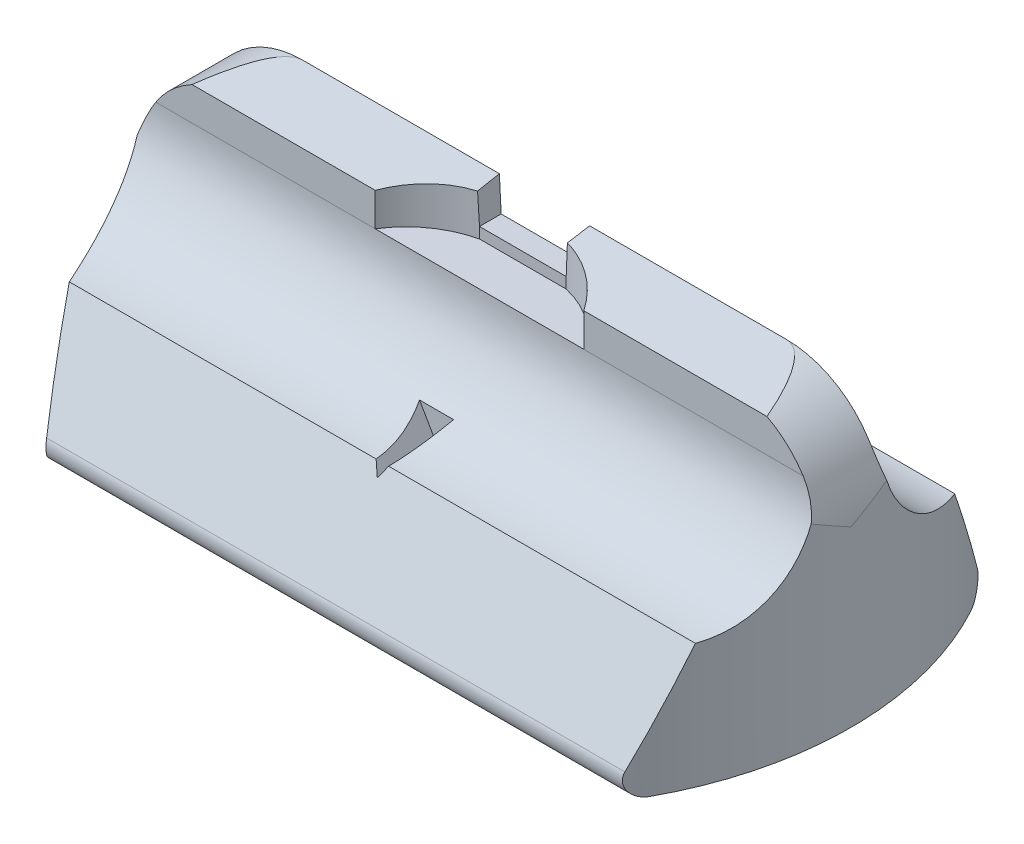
ISO-10303-21;
HEADER;
FILE_DESCRIPTION(('STEP AP214'),'2;1');
FILE_NAME('part.step','',(''),(''),'','','');
FILE_SCHEMA(('AUTOMOTIVE_DESIGN { 1 0 10303 214 1 1 1 1 }'));
ENDSEC;
DATA;
#1=APPLICATION_CONTEXT('core data for automotive mechanical design processes');
#2=APPLICATION_PROTOCOL_DEFINITION('international standard','automotive_design',2000,#1);
#3=PRODUCT_CONTEXT('',#1,'mechanical');
#4=PRODUCT('Part','Part','',(#3));
#5=PRODUCT_RELATED_PRODUCT_CATEGORY('part','',(#4));
#6=PRODUCT_DEFINITION_FORMATION('','',#4);
#7=PRODUCT_DEFINITION_CONTEXT('part definition',#1,'design');
#8=PRODUCT_DEFINITION('design','',#6,#7);
#9=PRODUCT_DEFINITION_SHAPE('','',#8);
#10=(LENGTH_UNIT() NAMED_UNIT(*) SI_UNIT(.MILLI.,.METRE.));
#11=(NAMED_UNIT(*) PLANE_ANGLE_UNIT() SI_UNIT($,.RADIAN.));
#12=(NAMED_UNIT(*) SI_UNIT($,.STERADIAN.) SOLID_ANGLE_UNIT());
#13=UNCERTAINTY_MEASURE_WITH_UNIT(LENGTH_MEASURE(1.E-05),#10,'distance_accuracy_value','');
#14=(GEOMETRIC_REPRESENTATION_CONTEXT(3) GLOBAL_UNCERTAINTY_ASSIGNED_CONTEXT((#13)) GLOBAL_UNIT_ASSIGNED_CONTEXT((#10,
#11,#12)) REPRESENTATION_CONTEXT('',''));
#15=CARTESIAN_POINT('',(0.,0.,0.));
#16=DIRECTION('',(0.,0.,1.));
#17=DIRECTION('',(1.,0.,0.));
#18=AXIS2_PLACEMENT_3D('',#15,#16,#17);
#19=CARTESIAN_POINT('',(-7.9502,0.,4.401));
#20=DIRECTION('',(0.,0.4226182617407,0.90630778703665));
#21=DIRECTION('',(0.,-0.90630778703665,0.4226182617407));
#22=AXIS2_PLACEMENT_3D('',#19,#20,#21);
#23=PLANE('',#22);
#24=CARTESIAN_POINT('',(-0.0761999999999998,9.43797495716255,0.));
#25=DIRECTION('',(0.,0.4226182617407,0.90630778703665));
#26=DIRECTION('',(0.,-0.90630778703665,0.4226182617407));
#27=AXIS2_PLACEMENT_3D('',#24,#25,#26);
#28=ELLIPSE('',#27,18.6314712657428,7.874);
#29=CARTESIAN_POINT('',(-6.77928757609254,0.578152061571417,4.13140326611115));
#30=VERTEX_POINT('',#29);
#31=CARTESIAN_POINT('',(-7.34014311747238,2.921,3.03891533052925));
#32=VERTEX_POINT('',#31);
#33=EDGE_CURVE('E470',#30,#32,#28,.F.);
#34=ORIENTED_EDGE('',*,*,#33,.F.);
#35=DIRECTION('',(1.,0.,0.));
#36=VECTOR('',#35,1.);
#37=CARTESIAN_POINT('',(-7.9502,0.57815206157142,4.13140326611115));
#38=LINE('',#37,#36);
#39=CARTESIAN_POINT('',(6.77928757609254,0.578152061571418,4.13140326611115));
#40=VERTEX_POINT('',#39);
#41=EDGE_CURVE('E11',#30,#40,#38,.T.);
#42=ORIENTED_EDGE('',*,*,#41,.T.);
#43=CARTESIAN_POINT('',(0.0761999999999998,9.43797495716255,0.));
#44=DIRECTION('',(0.,0.4226182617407,0.90630778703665));
#45=DIRECTION('',(0.,-0.90630778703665,0.4226182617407));
#46=AXIS2_PLACEMENT_3D('',#43,#44,#45);
#47=ELLIPSE('',#46,18.6314712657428,7.874);
#48=CARTESIAN_POINT('',(7.34014311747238,2.921,3.03891533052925));
#49=VERTEX_POINT('',#48);
#50=EDGE_CURVE('E411',#40,#49,#47,.T.);
#51=ORIENTED_EDGE('',*,*,#50,.T.);
#52=DIRECTION('',(1.,0.,0.));
#53=VECTOR('',#52,1.);
#54=CARTESIAN_POINT('',(-7.9502,2.921,3.03891533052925));
#55=LINE('',#54,#53);
#56=CARTESIAN_POINT('',(0.146646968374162,2.921,3.03891533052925));
#57=VERTEX_POINT('',#56);
#58=EDGE_CURVE('E481',#57,#49,#55,.T.);
#59=ORIENTED_EDGE('',*,*,#58,.F.);
#60=DIRECTION('',(-0.463622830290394,-0.803018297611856,0.374453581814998));
#61=VECTOR('',#60,1.);
#62=CARTESIAN_POINT('',(-2.9176853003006,-2.38657918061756,5.51388014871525));
#63=LINE('',#62,#61);
#64=CARTESIAN_POINT('',(0.,2.667,3.15735747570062));
#65=VERTEX_POINT('',#64);
#66=EDGE_CURVE('E199',#57,#65,#63,.T.);
#67=ORIENTED_EDGE('',*,*,#66,.T.);
#68=DIRECTION('',(-0.463622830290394,0.803018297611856,-0.374453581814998));
#69=VECTOR('',#68,1.);
#70=CARTESIAN_POINT('',(-0.500044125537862,3.53310183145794,2.75348755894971));
#71=LINE('',#70,#69);
#72=CARTESIAN_POINT('',(-0.146646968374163,2.921,3.03891533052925));
#73=VERTEX_POINT('',#72);
#74=EDGE_CURVE('E196',#65,#73,#71,.T.);
#75=ORIENTED_EDGE('',*,*,#74,.T.);
#76=EDGE_CURVE('E415',#32,#73,#55,.T.);
#77=ORIENTED_EDGE('',*,*,#76,.F.);
#78=EDGE_LOOP('',(#34,#42,#51,#59,#67,#75,#77));
#79=FACE_BOUND('',#78,.T.);
#80=ADVANCED_FACE('F31',(#79),#23,.T.);
#81=CARTESIAN_POINT('',(-7.9502,5.3064148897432,3.15));
#82=DIRECTION('',(1.,0.,0.));
#83=DIRECTION('',(0.,0.,-1.));
#84=AXIS2_PLACEMENT_3D('',#81,#82,#83);
#85=CYLINDRICAL_SURFACE('',#84,2.388);
#86=ORIENTED_EDGE('',*,*,#76,.T.);
#87=CARTESIAN_POINT('',(-1.52386689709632,5.3064148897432,3.15));
#88=DIRECTION('',(0.866025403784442,0.499999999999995,0.));
#89=DIRECTION('',(0.499999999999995,-0.866025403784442,0.));
#90=AXIS2_PLACEMENT_3D('',#87,#88,#89);
#91=ELLIPSE('',#90,2.75742488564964,2.388);
#92=CARTESIAN_POINT('',(-0.399122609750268,3.35830063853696,1.76891533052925));
#93=VERTEX_POINT('',#92);
#94=EDGE_CURVE('E358',#73,#93,#91,.T.);
#95=ORIENTED_EDGE('',*,*,#94,.T.);
#96=DIRECTION('',(-1.,0.,0.));
#97=VECTOR('',#96,1.);
#98=CARTESIAN_POINT('',(0.399122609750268,3.35830063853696,1.76891533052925));
#99=LINE('',#98,#97);
#100=CARTESIAN_POINT('',(0.399122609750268,3.35830063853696,1.76891533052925));
#101=VERTEX_POINT('',#100);
#102=EDGE_CURVE('E200',#101,#93,#99,.T.);
#103=ORIENTED_EDGE('',*,*,#102,.F.);
#104=CARTESIAN_POINT('',(1.52386689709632,5.3064148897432,3.15));
#105=DIRECTION('',(-0.866025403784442,0.499999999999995,0.));
#106=DIRECTION('',(0.499999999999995,0.866025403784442,0.));
#107=AXIS2_PLACEMENT_3D('',#104,#105,#106);
#108=ELLIPSE('',#107,2.75742488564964,2.388);
#109=EDGE_CURVE('E206',#101,#57,#108,.T.);
#110=ORIENTED_EDGE('',*,*,#109,.T.);
#111=ORIENTED_EDGE('',*,*,#58,.T.);
#112=CARTESIAN_POINT('',(7.34014311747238,2.921,3.03891533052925));
#113=CARTESIAN_POINT('',(7.3667319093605,2.92395233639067,2.97538021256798));
#114=CARTESIAN_POINT('',(7.39243392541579,2.92947386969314,2.91158305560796));
#115=CARTESIAN_POINT('',(7.44195935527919,2.94576785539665,2.7839043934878));
#116=CARTESIAN_POINT('',(7.46578206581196,2.95654226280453,2.72002286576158));
#117=CARTESIAN_POINT('',(7.51144575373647,2.98346539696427,2.59260211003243));
#118=CARTESIAN_POINT('',(7.53328480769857,2.99961927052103,2.52906326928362));
#119=CARTESIAN_POINT('',(7.57487801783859,3.03732123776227,2.40294061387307));
#120=CARTESIAN_POINT('',(7.59463246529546,3.05886857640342,2.3403566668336));
#121=CARTESIAN_POINT('',(7.65081201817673,3.13174514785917,2.1544892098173));
#122=CARTESIAN_POINT('',(7.68407134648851,3.19126101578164,2.0333216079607));
#123=CARTESIAN_POINT('',(7.74226458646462,3.33091954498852,1.80156887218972));
#124=CARTESIAN_POINT('',(7.76720769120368,3.41103925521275,1.69097214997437));
#125=CARTESIAN_POINT('',(7.80884682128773,3.58601241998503,1.48871400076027));
#126=CARTESIAN_POINT('',(7.82584866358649,3.68009367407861,1.39644701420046));
#127=CARTESIAN_POINT('',(7.85427656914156,3.88271475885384,1.22829166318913));
#128=CARTESIAN_POINT('',(7.86569988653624,3.99126167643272,1.15241137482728));
#129=CARTESIAN_POINT('',(7.88415426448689,4.2189973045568,1.01989798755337));
#130=CARTESIAN_POINT('',(7.89121022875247,4.33812116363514,0.963156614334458));
#131=CARTESIAN_POINT('',(7.90212495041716,4.58416340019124,0.870051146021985));
#132=CARTESIAN_POINT('',(7.90598618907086,4.71107564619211,0.83367124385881));
#133=CARTESIAN_POINT('',(7.91021233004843,4.91683816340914,0.79268743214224));
#134=CARTESIAN_POINT('',(7.91135971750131,4.99436498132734,0.781182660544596));
#135=CARTESIAN_POINT('',(7.91286904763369,5.15005523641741,0.765842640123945));
#136=CARTESIAN_POINT('',(7.91323225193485,5.22821744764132,0.761995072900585));
#137=CARTESIAN_POINT('',(7.91324229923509,5.3064148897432,0.762));
#138=B_SPLINE_CURVE_WITH_KNOTS('',3,(#112,#113,#114,#115,#116,#117,#118,#119,#120,#121,#122,
#123,#124,#125,#126,#127,#128,#129,#130,#131,#132,#133,#134,#135,#136,#137),.UNSPECIFIED.,.F.,
.F.,(4,2,2,2,2,2,2,2,2,2,2,2,4),(0.,0.206772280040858,0.413621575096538,0.620669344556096,
0.82768814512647,1.24246663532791,1.65678508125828,2.05346999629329,2.45034997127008,
2.84494547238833,3.23923421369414,3.47403959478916,3.70846693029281),.UNSPECIFIED.);
#139=CARTESIAN_POINT('',(7.90019321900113,4.54689278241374,0.886005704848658));
#140=VERTEX_POINT('',#139);
#141=EDGE_CURVE('E473',#49,#140,#138,.T.);
#142=ORIENTED_EDGE('',*,*,#141,.T.);
#143=CARTESIAN_POINT('',(3.74054767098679,5.3064148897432,0.762));
#144=CARTESIAN_POINT('',(3.80725359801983,5.41030400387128,0.762001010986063));
#145=CARTESIAN_POINT('',(3.88242579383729,5.50877184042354,0.768813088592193));
#146=CARTESIAN_POINT('',(4.04703515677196,5.69179245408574,0.791488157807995));
#147=CARTESIAN_POINT('',(4.13649614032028,5.77632151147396,0.807366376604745));
#148=CARTESIAN_POINT('',(4.32663933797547,5.92918676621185,0.843307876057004));
#149=CARTESIAN_POINT('',(4.42725274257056,5.99761492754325,0.863346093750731));
#150=CARTESIAN_POINT('',(4.63803766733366,6.11770339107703,0.903144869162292));
#151=CARTESIAN_POINT('',(4.74820814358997,6.16936552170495,0.922905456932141));
#152=CARTESIAN_POINT('',(4.98425229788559,6.25777365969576,0.959122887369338));
#153=CARTESIAN_POINT('',(5.11068553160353,6.29320099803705,0.975245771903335));
#154=CARTESIAN_POINT('',(5.30391403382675,6.32974635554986,0.992339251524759));
#155=CARTESIAN_POINT('',(5.36892168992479,6.33916222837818,0.996855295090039));
#156=CARTESIAN_POINT('',(5.49963085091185,6.35237579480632,1.00324377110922));
#157=CARTESIAN_POINT('',(5.56533227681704,6.35617412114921,1.00511650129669));
#158=CARTESIAN_POINT('',(5.75159539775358,6.3588572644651,1.00641436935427));
#159=CARTESIAN_POINT('',(5.87235704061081,6.3510322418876,1.00251047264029));
#160=CARTESIAN_POINT('',(6.11051211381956,6.31660490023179,0.986115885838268));
#161=CARTESIAN_POINT('',(6.22790404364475,6.28999434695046,0.973621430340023));
#162=CARTESIAN_POINT('',(6.45421068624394,6.21972296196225,0.9432296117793));
#163=CARTESIAN_POINT('',(6.56324328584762,6.17639210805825,0.925438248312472));
#164=CARTESIAN_POINT('',(6.77322894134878,6.07374179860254,0.887980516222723));
#165=CARTESIAN_POINT('',(6.87417512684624,6.01440893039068,0.868312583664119));
#166=CARTESIAN_POINT('',(7.07617871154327,5.87380283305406,0.829119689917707));
#167=CARTESIAN_POINT('',(7.17614469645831,5.79088445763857,0.809824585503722));
#168=CARTESIAN_POINT('',(7.36114844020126,5.60855231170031,0.77939781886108));
#169=CARTESIAN_POINT('',(7.44620750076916,5.50916248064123,0.768254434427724));
#170=CARTESIAN_POINT('',(7.58119869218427,5.32082485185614,0.760625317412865));
#171=CARTESIAN_POINT('',(7.63472773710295,5.23456495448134,0.761404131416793));
#172=CARTESIAN_POINT('',(7.72960461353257,5.05628075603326,0.773461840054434));
#173=CARTESIAN_POINT('',(7.77096341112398,4.96426173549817,0.784731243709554));
#174=CARTESIAN_POINT('',(7.84077455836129,4.77727262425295,0.81941736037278));
#175=CARTESIAN_POINT('',(7.86918469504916,4.68229394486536,0.842873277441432));
#176=CARTESIAN_POINT('',(7.91301095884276,4.49333121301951,0.902500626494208));
#177=CARTESIAN_POINT('',(7.92842477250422,4.39934734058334,0.938674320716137));
#178=CARTESIAN_POINT('',(7.94704274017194,4.22021749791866,1.02115371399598));
#179=CARTESIAN_POINT('',(7.95079461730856,4.13486380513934,1.06689331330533));
#180=CARTESIAN_POINT('',(7.94945208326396,3.97041852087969,1.16833341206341));
#181=CARTESIAN_POINT('',(7.94435532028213,3.89132860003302,1.22403655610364));
#182=CARTESIAN_POINT('',(7.92655343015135,3.73287227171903,1.35059366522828));
#183=CARTESIAN_POINT('',(7.91309288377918,3.65438095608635,1.42243086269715));
#184=CARTESIAN_POINT('',(7.88098718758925,3.50809367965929,1.57526306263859));
#185=CARTESIAN_POINT('',(7.86233785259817,3.44030642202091,1.65626542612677));
#186=CARTESIAN_POINT('',(7.81901202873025,3.30414194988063,1.84262400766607));
#187=CARTESIAN_POINT('',(7.79386820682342,3.23820255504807,1.94965598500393));
#188=CARTESIAN_POINT('',(7.74545914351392,3.12371239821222,2.1732130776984));
#189=CARTESIAN_POINT('',(7.72219509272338,3.07517259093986,2.28974411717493));
#190=CARTESIAN_POINT('',(7.69152768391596,3.01481086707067,2.47488166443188));
#191=CARTESIAN_POINT('',(7.68174063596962,2.99635483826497,2.54098768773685));
#192=CARTESIAN_POINT('',(7.66480533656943,2.96515521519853,2.67485327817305));
#193=CARTESIAN_POINT('',(7.65765580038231,2.95240883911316,2.74261202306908));
#194=CARTESIAN_POINT('',(7.6465361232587,2.93282315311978,2.87915853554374));
#195=CARTESIAN_POINT('',(7.64256210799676,2.92597664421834,2.94794494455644));
#196=CARTESIAN_POINT('',(7.63807852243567,2.9182727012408,3.08594109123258));
#197=CARTESIAN_POINT('',(7.6375684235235,2.91741435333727,3.15515076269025));
#198=CARTESIAN_POINT('',(7.64103939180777,2.92333389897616,3.34494631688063));
#199=CARTESIAN_POINT('',(7.64865487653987,2.93628633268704,3.4653412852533));
#200=CARTESIAN_POINT('',(7.67297469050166,2.97993613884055,3.70187026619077));
#201=CARTESIAN_POINT('',(7.68968605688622,3.0106472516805,3.81800090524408));
#202=CARTESIAN_POINT('',(7.72879130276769,3.08892770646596,4.04427552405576));
#203=CARTESIAN_POINT('',(7.75122339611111,3.13661130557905,4.15437294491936));
#204=CARTESIAN_POINT('',(7.79753009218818,3.24775939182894,4.36605715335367));
#205=CARTESIAN_POINT('',(7.82140607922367,3.31123921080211,4.46763554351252));
#206=CARTESIAN_POINT('',(7.86931318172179,3.46273962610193,4.67378394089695));
#207=CARTESIAN_POINT('',(7.89292297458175,3.55292457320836,4.77687886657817));
#208=CARTESIAN_POINT('',(7.92982443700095,3.75073543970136,4.9668940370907));
#209=CARTESIAN_POINT('',(7.94313593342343,3.85832736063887,5.05384511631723));
#210=CARTESIAN_POINT('',(7.95169450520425,4.05671837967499,5.18741000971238));
#211=CARTESIAN_POINT('',(7.95082873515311,4.1442828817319,5.23858790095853));
#212=CARTESIAN_POINT('',(7.93792662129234,4.32454229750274,5.32913049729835));
#213=CARTESIAN_POINT('',(7.92590052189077,4.41723243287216,5.36850599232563));
#214=CARTESIAN_POINT('',(7.88912605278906,4.60490220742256,5.43481112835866));
#215=CARTESIAN_POINT('',(7.86433629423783,4.6998883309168,5.46169973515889));
#216=CARTESIAN_POINT('',(7.80158488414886,4.88820384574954,5.50307130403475));
#217=CARTESIAN_POINT('',(7.76362045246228,4.98153288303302,5.51755164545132));
#218=CARTESIAN_POINT('',(7.67726004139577,5.15886536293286,5.53502670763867));
#219=CARTESIAN_POINT('',(7.62943477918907,5.24310080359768,5.53852678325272));
#220=CARTESIAN_POINT('',(7.5235492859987,5.40476437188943,5.53734471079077));
#221=CARTESIAN_POINT('',(7.46548644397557,5.48219075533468,5.53266047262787));
#222=CARTESIAN_POINT('',(7.33392371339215,5.63632940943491,5.51649864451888));
#223=CARTESIAN_POINT('',(7.25944754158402,5.7121357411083,5.50436721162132));
#224=CARTESIAN_POINT('',(7.10117455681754,5.85240088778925,5.47584967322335));
#225=CARTESIAN_POINT('',(7.01736980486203,5.91684991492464,5.4594599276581));
#226=CARTESIAN_POINT('',(6.82693260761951,6.04342934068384,5.42253337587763));
#227=CARTESIAN_POINT('',(6.71884102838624,6.10330463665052,5.40176513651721));
#228=CARTESIAN_POINT('',(6.49389197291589,6.20504766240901,5.36314016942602));
#229=CARTESIAN_POINT('',(6.37703355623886,6.24691345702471,5.34528375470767));
#230=CARTESIAN_POINT('',(6.19469490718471,6.29590095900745,5.32342775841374));
#231=CARTESIAN_POINT('',(6.13134243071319,6.3100658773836,5.31688378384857));
#232=CARTESIAN_POINT('',(6.00347987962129,6.33297499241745,5.30612661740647));
#233=CARTESIAN_POINT('',(5.9389703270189,6.34172157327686,5.30191240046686));
#234=CARTESIAN_POINT('',(5.8093564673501,6.35367528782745,5.29612091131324));
#235=CARTESIAN_POINT('',(5.74425252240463,6.35688559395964,5.29454212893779));
#236=CARTESIAN_POINT('',(5.61401940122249,6.35773913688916,5.29412129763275));
#237=CARTESIAN_POINT('',(5.5488902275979,6.35538284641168,5.29527901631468));
#238=CARTESIAN_POINT('',(5.36700038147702,6.34098888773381,5.30228812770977));
#239=CARTESIAN_POINT('',(5.25078557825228,6.32269530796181,5.31116257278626));
#240=CARTESIAN_POINT('',(5.02324792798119,6.26879036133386,5.33568649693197));
#241=CARTESIAN_POINT('',(4.91192805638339,6.23316861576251,5.35134003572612));
#242=CARTESIAN_POINT('',(4.69273291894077,6.14416388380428,5.38675731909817));
#243=CARTESIAN_POINT('',(4.58511045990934,6.09020851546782,5.40664463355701));
#244=CARTESIAN_POINT('',(4.37953142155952,5.96605843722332,5.44601010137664));
#245=CARTESIAN_POINT('',(4.28158213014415,5.8958516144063,5.46548793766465));
#246=CARTESIAN_POINT('',(4.08971324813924,5.73381857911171,5.50101499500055));
#247=CARTESIAN_POINT('',(3.99679574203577,5.64068514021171,5.51664780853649));
#248=CARTESIAN_POINT('',(3.8701697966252,5.48966621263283,5.5314977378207));
#249=CARTESIAN_POINT('',(3.8300827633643,5.4374342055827,5.53501441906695));
#250=CARTESIAN_POINT('',(3.7545261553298,5.32963800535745,5.53849427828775));
#251=CARTESIAN_POINT('',(3.71905308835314,5.27407637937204,5.53846015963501));
#252=CARTESIAN_POINT('',(3.65691297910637,5.16679887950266,5.53444782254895));
#253=CARTESIAN_POINT('',(3.6297020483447,5.11538020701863,5.53092568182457));
#254=CARTESIAN_POINT('',(3.57941824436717,5.01095464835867,5.52023193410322));
#255=CARTESIAN_POINT('',(3.55634281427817,4.95794876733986,5.5130625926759));
#256=CARTESIAN_POINT('',(3.51447814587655,4.85096823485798,5.49479257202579));
#257=CARTESIAN_POINT('',(3.49568590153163,4.79699429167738,5.48369466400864));
#258=CARTESIAN_POINT('',(3.46241522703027,4.6887365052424,5.45740691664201));
#259=CARTESIAN_POINT('',(3.44793623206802,4.63445270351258,5.44221761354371));
#260=CARTESIAN_POINT('',(3.41473323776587,4.48901610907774,5.39578553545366));
#261=CARTESIAN_POINT('',(3.39992412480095,4.39814872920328,5.36068215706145));
#262=CARTESIAN_POINT('',(3.38132202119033,4.2205734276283,5.27910018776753));
#263=CARTESIAN_POINT('',(3.37753129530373,4.13386636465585,5.23261926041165));
#264=CARTESIAN_POINT('',(3.37907530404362,3.96536266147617,5.12841395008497));
#265=CARTESIAN_POINT('',(3.38458411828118,3.88369002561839,5.07049340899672));
#266=CARTESIAN_POINT('',(3.40267552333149,3.72872270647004,4.94537439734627));
#267=CARTESIAN_POINT('',(3.41526047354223,3.65543082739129,4.87817283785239));
#268=CARTESIAN_POINT('',(3.44754151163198,3.50659847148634,4.72370986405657));
#269=CARTESIAN_POINT('',(3.46807955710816,3.4327682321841,4.63497732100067));
#270=CARTESIAN_POINT('',(3.5115499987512,3.29879157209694,4.44817188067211));
#271=CARTESIAN_POINT('',(3.53448554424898,3.2386634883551,4.35008671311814));
#272=CARTESIAN_POINT('',(3.58267045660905,3.12397244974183,4.12853573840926));
#273=CARTESIAN_POINT('',(3.60765110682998,3.07208961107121,4.00358876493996));
#274=CARTESIAN_POINT('',(3.63913588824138,3.01049552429,3.81021768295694));
#275=CARTESIAN_POINT('',(3.64863339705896,2.99266877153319,3.74476593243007));
#276=CARTESIAN_POINT('',(3.6650121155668,2.96260516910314,3.61228166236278));
#277=CARTESIAN_POINT('',(3.67189483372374,2.95036509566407,3.5452500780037));
#278=CARTESIAN_POINT('',(3.68229865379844,2.93207696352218,3.41324644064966));
#279=CARTESIAN_POINT('',(3.68595959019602,2.92577041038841,3.34832113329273));
#280=CARTESIAN_POINT('',(3.69019078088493,2.91849440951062,3.21806998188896));
#281=CARTESIAN_POINT('',(3.6907611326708,2.91752479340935,3.152744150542));
#282=CARTESIAN_POINT('',(3.68876806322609,2.92093986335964,3.02230115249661));
#283=CARTESIAN_POINT('',(3.68620570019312,2.92532274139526,2.95718392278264));
#284=CARTESIAN_POINT('',(3.67813655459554,2.93936748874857,2.82769781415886));
#285=CARTESIAN_POINT('',(3.67262861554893,2.94903143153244,2.76332923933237));
#286=CARTESIAN_POINT('',(3.65361107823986,2.98325217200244,2.5851976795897));
#287=CARTESIAN_POINT('',(3.63722054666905,3.01354141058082,2.4727944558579));
#288=CARTESIAN_POINT('',(3.59926826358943,3.08970872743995,2.25435223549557));
#289=CARTESIAN_POINT('',(3.57770197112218,3.13560050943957,2.14831893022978));
#290=CARTESIAN_POINT('',(3.5305128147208,3.2483528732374,1.93200379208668));
#291=CARTESIAN_POINT('',(3.50471266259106,3.31705927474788,1.82271877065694));
#292=CARTESIAN_POINT('',(3.45678926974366,3.47163746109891,1.61613067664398));
#293=CARTESIAN_POINT('',(3.43466409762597,3.5575001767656,1.51882131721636));
#294=CARTESIAN_POINT('',(3.40232167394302,3.73047192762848,1.35249096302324));
#295=CARTESIAN_POINT('',(3.39079607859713,3.8153568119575,1.28142110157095));
#296=CARTESIAN_POINT('',(3.37772222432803,3.99470510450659,1.15145227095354));
#297=CARTESIAN_POINT('',(3.37616552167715,4.08916033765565,1.09254304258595));
#298=CARTESIAN_POINT('',(3.38612950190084,4.28566030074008,0.988275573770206));
#299=CARTESIAN_POINT('',(3.39774885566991,4.38775687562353,0.94302283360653));
#300=CARTESIAN_POINT('',(3.4364176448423,4.59463758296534,0.867895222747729));
#301=CARTESIAN_POINT('',(3.46345527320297,4.69941960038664,0.838008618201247));
#302=CARTESIAN_POINT('',(3.52791504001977,4.89024781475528,0.796845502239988));
#303=CARTESIAN_POINT('',(3.5630039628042,4.97662513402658,0.783366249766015));
#304=CARTESIAN_POINT('',(3.64394153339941,5.14518707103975,0.765941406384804));
#305=CARTESIAN_POINT('',(3.68979402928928,5.22737017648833,0.761999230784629));
#306=CARTESIAN_POINT('',(3.74054767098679,5.3064148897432,0.762));
#307=B_SPLINE_CURVE_WITH_KNOTS('',3,(#143,#144,#145,#146,#147,#148,#149,#150,#151,#152,#153,
#154,#155,#156,#157,#158,#159,#160,#161,#162,#163,#164,#165,#166,#167,#168,#169,#170,#171,#172,
#173,#174,#175,#176,#177,#178,#179,#180,#181,#182,#183,#184,#185,#186,#187,#188,#189,#190,#191,
#192,#193,#194,#195,#196,#197,#198,#199,#200,#201,#202,#203,#204,#205,#206,#207,#208,#209,#210,
#211,#212,#213,#214,#215,#216,#217,#218,#219,#220,#221,#222,#223,#224,#225,#226,#227,#228,#229,
#230,#231,#232,#233,#234,#235,#236,#237,#238,#239,#240,#241,#242,#243,#244,#245,#246,#247,#248,
#249,#250,#251,#252,#253,#254,#255,#256,#257,#258,#259,#260,#261,#262,#263,#264,#265,#266,#267,
#268,#269,#270,#271,#272,#273,#274,#275,#276,#277,#278,#279,#280,#281,#282,#283,#284,#285,#286,
#287,#288,#289,#290,#291,#292,#293,#294,#295,#296,#297,#298,#299,#300,#301,#302,#303,#304,#305,
#306),.UNSPECIFIED.,.T.,.F.,(4,2,2,2,2,2,2,2,2,2,2,2,2,2,2,2,2,2,2,2,2,2,2,2,2,2,2,2,2,2,2,2,2,
2,2,2,2,2,2,2,2,2,2,2,2,2,2,2,2,2,2,2,2,2,2,2,2,2,2,2,2,2,2,2,2,2,2,2,2,2,2,2,2,2,2,2,2,2,2,2,2,
4),(0.,0.369957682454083,0.740538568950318,1.10894842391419,1.47731808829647,1.87182867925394,
2.06909409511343,2.26633728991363,2.62755523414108,2.98893160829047,3.34351355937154,
3.69839364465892,4.0903701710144,4.48178191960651,4.78506043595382,5.08806483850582,
5.39205009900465,5.69608945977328,5.98561500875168,6.27521751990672,6.5957931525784,
6.91662810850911,7.2997178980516,7.68304845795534,7.89077515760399,8.09840053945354,
8.30577221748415,8.51311224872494,8.87513305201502,9.23743433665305,9.60222221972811,
9.9673655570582,10.3822150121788,10.7962637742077,11.0992726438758,11.4020036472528,
11.7057225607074,12.0095056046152,12.2990852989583,12.5887389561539,12.9084170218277,
13.2283692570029,13.6026916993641,13.9770543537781,14.1725570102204,14.3679735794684,
14.5632781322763,14.7585661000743,15.1107074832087,15.4630600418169,15.8276152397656,
16.1924430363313,16.587422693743,16.7849528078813,16.9823325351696,17.156910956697,
17.3313810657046,17.5057283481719,17.68005279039,17.9741110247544,18.2682296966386,
18.5679152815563,18.8677008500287,19.2181097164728,19.5689848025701,19.9794592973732,
20.1847142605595,20.3898506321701,20.5855684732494,20.7812801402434,20.9769257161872,
21.1726481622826,21.523769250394,21.8751995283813,22.2684642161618,22.6615215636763,
22.9941063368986,23.3264093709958,23.6612174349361,23.9957694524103,24.2771534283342,
24.5586381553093),.UNSPECIFIED.);
#308=CARTESIAN_POINT('',(7.58785232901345,5.30641488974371,0.761999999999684));
#309=VERTEX_POINT('',#308);
#310=EDGE_CURVE('E449',#309,#140,#307,.T.);
#311=ORIENTED_EDGE('',*,*,#310,.F.);
#312=DIRECTION('',(1.,0.,0.));
#313=VECTOR('',#312,1.);
#314=CARTESIAN_POINT('',(-7.9502,5.3064148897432,0.762));
#315=LINE('',#314,#313);
#316=CARTESIAN_POINT('',(2.44573393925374,5.30641488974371,0.761999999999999));
#317=VERTEX_POINT('',#316);
#318=EDGE_CURVE('E484',#317,#309,#315,.T.);
#319=ORIENTED_EDGE('',*,*,#318,.F.);
#320=DIRECTION('',(1.,0.,0.));
#321=VECTOR('',#320,1.);
#322=CARTESIAN_POINT('',(2.44573393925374,5.30641488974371,0.761999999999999));
#323=LINE('',#322,#321);
#324=CARTESIAN_POINT('',(-2.44573393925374,5.3064148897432,0.762));
#325=VERTEX_POINT('',#324);
#326=EDGE_CURVE('E240',#325,#317,#323,.T.);
#327=ORIENTED_EDGE('',*,*,#326,.F.);
#328=CARTESIAN_POINT('',(-7.58785232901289,5.30641488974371,0.762));
#329=VERTEX_POINT('',#328);
#330=EDGE_CURVE('E482',#329,#325,#315,.T.);
#331=ORIENTED_EDGE('',*,*,#330,.F.);
#332=CARTESIAN_POINT('',(-7.63966581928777,2.921,3.03891533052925));
#333=CARTESIAN_POINT('',(-7.64138824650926,2.92400168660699,2.97422835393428));
#334=CARTESIAN_POINT('',(-7.64469502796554,2.92965235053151,2.90972989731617));
#335=CARTESIAN_POINT('',(-7.65410702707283,2.94611353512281,2.78166374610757));
#336=CARTESIAN_POINT('',(-7.66020945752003,2.95691891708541,2.71809518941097));
#337=CARTESIAN_POINT('',(-7.6748078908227,2.98348609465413,2.59265111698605));
#338=CARTESIAN_POINT('',(-7.68329080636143,2.99922084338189,2.53076831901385));
#339=CARTESIAN_POINT('',(-7.70213534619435,3.03548752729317,2.40872428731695));
#340=CARTESIAN_POINT('',(-7.71249741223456,3.05602059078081,2.34856346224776));
#341=CARTESIAN_POINT('',(-7.74545717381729,3.12440754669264,2.17156819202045));
#342=CARTESIAN_POINT('',(-7.77000003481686,3.17916487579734,2.05768279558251));
#343=CARTESIAN_POINT('',(-7.81933036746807,3.30595189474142,1.83978486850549));
#344=CARTESIAN_POINT('',(-7.8441182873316,3.37802306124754,1.73579689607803));
#345=CARTESIAN_POINT('',(-7.89061090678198,3.54507271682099,1.53169013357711));
#346=CARTESIAN_POINT('',(-7.91189603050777,3.64144512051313,1.43258805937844));
#347=CARTESIAN_POINT('',(-7.93445811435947,3.79838007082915,1.29712128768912));
#348=CARTESIAN_POINT('',(-7.94041701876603,3.85271422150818,1.254187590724));
#349=CARTESIAN_POINT('',(-7.94842263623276,3.96508632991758,1.1730888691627));
#350=CARTESIAN_POINT('',(-7.9504712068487,4.02312251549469,1.13492158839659));
#351=CARTESIAN_POINT('',(-7.9497441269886,4.16783967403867,1.04857509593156));
#352=CARTESIAN_POINT('',(-7.94453201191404,4.25616070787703,1.00309013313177));
#353=CARTESIAN_POINT('',(-7.92266522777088,4.43656491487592,0.923881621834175));
#354=CARTESIAN_POINT('',(-7.9060161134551,4.52864624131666,0.890152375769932));
#355=CARTESIAN_POINT('',(-7.86021242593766,4.71355863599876,0.834745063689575));
#356=CARTESIAN_POINT('',(-7.83103026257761,4.80639091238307,0.813093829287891));
#357=CARTESIAN_POINT('',(-7.76015267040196,4.98916705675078,0.781351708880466));
#358=CARTESIAN_POINT('',(-7.71846616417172,5.07911293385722,0.771252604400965));
#359=CARTESIAN_POINT('',(-7.65802221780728,5.18993946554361,0.764720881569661));
#360=CARTESIAN_POINT('',(-7.64455975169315,5.21360302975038,0.763688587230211));
#361=CARTESIAN_POINT('',(-7.61681834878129,5.26039946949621,0.762329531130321));
#362=CARTESIAN_POINT('',(-7.60254121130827,5.28353336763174,0.762001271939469));
#363=CARTESIAN_POINT('',(-7.58785232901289,5.30641488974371,0.762));
#364=B_SPLINE_CURVE_WITH_KNOTS('',3,(#332,#333,#334,#335,#336,#337,#338,#339,#340,#341,#342,
#343,#344,#345,#346,#347,#348,#349,#350,#351,#352,#353,#354,#355,#356,#357,#358,#359,#360,#361,
#362,#363),.UNSPECIFIED.,.F.,.F.,(4,2,2,2,2,2,2,2,2,2,2,2,2,2,2,4),(0.,0.194231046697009,
0.388268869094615,0.581260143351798,0.774296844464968,1.15872482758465,1.54408308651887,
1.96104491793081,2.16924919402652,2.37735454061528,2.67441609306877,2.97133346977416,
3.26890785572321,3.56627040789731,3.6479890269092,3.72953366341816),.UNSPECIFIED.);
#365=CARTESIAN_POINT('',(-7.90019321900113,4.54689278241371,0.886005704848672));
#366=VERTEX_POINT('',#365);
#367=EDGE_CURVE('E259',#366,#329,#364,.T.);
#368=ORIENTED_EDGE('',*,*,#367,.F.);
#369=CARTESIAN_POINT('',(-7.34014311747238,2.921,3.03891533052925));
#370=CARTESIAN_POINT('',(-7.3667319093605,2.92395233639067,2.97538021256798));
#371=CARTESIAN_POINT('',(-7.39243392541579,2.92947386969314,2.91158305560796));
#372=CARTESIAN_POINT('',(-7.44195935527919,2.94576785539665,2.7839043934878));
#373=CARTESIAN_POINT('',(-7.46578206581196,2.95654226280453,2.72002286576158));
#374=CARTESIAN_POINT('',(-7.51144575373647,2.98346539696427,2.59260211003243));
#375=CARTESIAN_POINT('',(-7.53328480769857,2.99961927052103,2.52906326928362));
#376=CARTESIAN_POINT('',(-7.57487801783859,3.03732123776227,2.40294061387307));
#377=CARTESIAN_POINT('',(-7.59463246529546,3.05886857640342,2.3403566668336));
#378=CARTESIAN_POINT('',(-7.65081201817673,3.13174514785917,2.1544892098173));
#379=CARTESIAN_POINT('',(-7.68407134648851,3.19126101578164,2.0333216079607));
#380=CARTESIAN_POINT('',(-7.74226458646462,3.33091954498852,1.80156887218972));
#381=CARTESIAN_POINT('',(-7.76720769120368,3.41103925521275,1.69097214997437));
#382=CARTESIAN_POINT('',(-7.80884682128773,3.58601241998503,1.48871400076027));
#383=CARTESIAN_POINT('',(-7.82584866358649,3.68009367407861,1.39644701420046));
#384=CARTESIAN_POINT('',(-7.85427656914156,3.88271475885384,1.22829166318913));
#385=CARTESIAN_POINT('',(-7.86569988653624,3.99126167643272,1.15241137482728));
#386=CARTESIAN_POINT('',(-7.88415426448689,4.2189973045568,1.01989798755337));
#387=CARTESIAN_POINT('',(-7.89121022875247,4.33812116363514,0.963156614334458));
#388=CARTESIAN_POINT('',(-7.90212495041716,4.58416340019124,0.870051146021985));
#389=CARTESIAN_POINT('',(-7.90598618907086,4.71107564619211,0.83367124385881));
#390=CARTESIAN_POINT('',(-7.91021233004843,4.91683816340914,0.79268743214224));
#391=CARTESIAN_POINT('',(-7.91135971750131,4.99436498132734,0.781182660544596));
#392=CARTESIAN_POINT('',(-7.91286904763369,5.15005523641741,0.765842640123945));
#393=CARTESIAN_POINT('',(-7.91323225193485,5.22821744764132,0.761995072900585));
#394=CARTESIAN_POINT('',(-7.91324229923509,5.3064148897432,0.762));
#395=B_SPLINE_CURVE_WITH_KNOTS('',3,(#369,#370,#371,#372,#373,#374,#375,#376,#377,#378,#379,
#380,#381,#382,#383,#384,#385,#386,#387,#388,#389,#390,#391,#392,#393,#394),.UNSPECIFIED.,.F.,
.F.,(4,2,2,2,2,2,2,2,2,2,2,2,4),(0.,0.206772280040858,0.413621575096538,0.620669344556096,
0.82768814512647,1.24246663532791,1.65678508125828,2.05346999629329,2.45034997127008,
2.84494547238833,3.23923421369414,3.47403959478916,3.70846693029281),.UNSPECIFIED.);
#396=EDGE_CURVE('E312',#32,#366,#395,.T.);
#397=ORIENTED_EDGE('',*,*,#396,.F.);
#398=EDGE_LOOP('',(#86,#95,#103,#110,#111,#142,#311,#319,#327,#331,#368,#397));
#399=FACE_BOUND('',#398,.T.);
#400=ADVANCED_FACE('F271',(#399),#85,.F.);
#401=CARTESIAN_POINT('',(-7.9502,6.223,0.));
#402=DIRECTION('',(0.,0.984807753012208,0.173648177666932));
#403=DIRECTION('',(0.,-0.173648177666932,0.984807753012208));
#404=AXIS2_PLACEMENT_3D('',#401,#402,#403);
#405=PLANE('',#404);
#406=DIRECTION('',(0.00910013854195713,-0.173640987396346,0.984766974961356));
#407=VECTOR('',#406,1.);
#408=CARTESIAN_POINT('',(-1.05129597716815,6.23390225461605,-0.0618297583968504));
#409=LINE('',#408,#407);
#410=CARTESIAN_POINT('',(-1.05776618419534,6.35736115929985,-0.762));
#411=VERTEX_POINT('',#410);
#412=CARTESIAN_POINT('',(-1.0529908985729,6.26624328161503,-0.245244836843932));
#413=VERTEX_POINT('',#412);
#414=EDGE_CURVE('E224',#411,#413,#409,.T.);
#415=ORIENTED_EDGE('',*,*,#414,.F.);
#416=DIRECTION('',(1.,0.,0.));
#417=VECTOR('',#416,1.);
#418=CARTESIAN_POINT('',(-7.9502,6.35736115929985,-0.762));
#419=LINE('',#418,#417);
#420=CARTESIAN_POINT('',(-5.6642,6.35736115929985,-0.762));
#421=VERTEX_POINT('',#420);
#422=EDGE_CURVE('E398',#421,#411,#419,.T.);
#423=ORIENTED_EDGE('',*,*,#422,.F.);
#424=CARTESIAN_POINT('',(-5.6642,4.07136115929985,12.202550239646));
#425=DIRECTION('',(0.,0.984807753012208,0.173648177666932));
#426=DIRECTION('',(0.,-0.173648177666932,0.984807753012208));
#427=AXIS2_PLACEMENT_3D('',#424,#425,#426);
#428=ELLIPSE('',#427,13.1645493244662,2.286);
#429=CARTESIAN_POINT('',(-6.73955424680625,6.08863884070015,0.762));
#430=VERTEX_POINT('',#429);
#431=EDGE_CURVE('E699',#430,#421,#428,.F.);
#432=ORIENTED_EDGE('',*,*,#431,.F.);
#433=DIRECTION('',(1.,0.,0.));
#434=VECTOR('',#433,1.);
#435=CARTESIAN_POINT('',(-7.9502,6.08863884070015,0.762));
#436=LINE('',#435,#434);
#437=CARTESIAN_POINT('',(-2.44573393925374,6.08863884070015,0.761999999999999));
#438=VERTEX_POINT('',#437);
#439=EDGE_CURVE('E406',#430,#438,#436,.T.);
#440=ORIENTED_EDGE('',*,*,#439,.T.);
#441=CARTESIAN_POINT('',(-0.508,5.87478225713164,1.97484095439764));
#442=DIRECTION('',(0.,0.984807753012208,0.173648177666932));
#443=DIRECTION('',(0.,0.173648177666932,-0.984807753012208));
#444=AXIS2_PLACEMENT_3D('',#441,#442,#443);
#445=ELLIPSE('',#444,2.32126523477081,2.286);
#446=EDGE_CURVE('E246',#413,#438,#445,.T.);
#447=ORIENTED_EDGE('',*,*,#446,.F.);
#448=EDGE_LOOP('',(#415,#423,#432,#440,#447));
#449=FACE_BOUND('',#448,.T.);
#450=ADVANCED_FACE('F499',(#449),#405,.T.);
#451=CARTESIAN_POINT('',(-7.9502,6.08863884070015,0.762));
#452=DIRECTION('',(0.,0.,1.));
#453=DIRECTION('',(0.,-1.,0.));
#454=AXIS2_PLACEMENT_3D('',#451,#452,#453);
#455=PLANE('',#454);
#456=DIRECTION('',(0.,1.,0.));
#457=VECTOR('',#456,1.);
#458=CARTESIAN_POINT('',(2.44573393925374,5.30641488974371,0.761999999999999));
#459=LINE('',#458,#457);
#460=CARTESIAN_POINT('',(2.44573393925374,6.08863884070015,0.761999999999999));
#461=VERTEX_POINT('',#460);
#462=EDGE_CURVE('E244',#317,#461,#459,.T.);
#463=ORIENTED_EDGE('',*,*,#462,.F.);
#464=ORIENTED_EDGE('',*,*,#318,.T.);
#465=CARTESIAN_POINT('',(5.6642,4.07136115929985,0.761999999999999));
#466=DIRECTION('',(0.,0.,1.));
#467=DIRECTION('',(0.,-1.,0.));
#468=AXIS2_PLACEMENT_3D('',#465,#466,#467);
#469=CIRCLE('',#468,2.286);
#470=CARTESIAN_POINT('',(6.73955424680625,6.08863884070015,0.762));
#471=VERTEX_POINT('',#470);
#472=EDGE_CURVE('E436',#471,#309,#469,.F.);
#473=ORIENTED_EDGE('',*,*,#472,.F.);
#474=EDGE_CURVE('E402',#461,#471,#436,.T.);
#475=ORIENTED_EDGE('',*,*,#474,.F.);
#476=EDGE_LOOP('',(#463,#464,#473,#475));
#477=FACE_BOUND('',#476,.T.);
#478=ADVANCED_FACE('F497',(#477),#455,.T.);
#479=DIRECTION('',(0.00910013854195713,0.173640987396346,-0.984766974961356));
#480=VECTOR('',#479,1.);
#481=CARTESIAN_POINT('',(1.04997922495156,6.20877712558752,0.0806619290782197));
#482=LINE('',#481,#480);
#483=CARTESIAN_POINT('',(1.0529908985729,6.26624328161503,-0.245244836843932));
#484=VERTEX_POINT('',#483);
#485=CARTESIAN_POINT('',(1.05776618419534,6.35736115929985,-0.762));
#486=VERTEX_POINT('',#485);
#487=EDGE_CURVE('E228',#484,#486,#482,.T.);
#488=ORIENTED_EDGE('',*,*,#487,.F.);
#489=CARTESIAN_POINT('',(0.508,5.87478225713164,1.97484095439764));
#490=DIRECTION('',(0.,0.984807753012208,0.173648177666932));
#491=DIRECTION('',(0.,0.173648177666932,-0.984807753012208));
#492=AXIS2_PLACEMENT_3D('',#489,#490,#491);
#493=ELLIPSE('',#492,2.32126523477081,2.286);
#494=EDGE_CURVE('E256',#461,#484,#493,.T.);
#495=ORIENTED_EDGE('',*,*,#494,.F.);
#496=ORIENTED_EDGE('',*,*,#474,.T.);
#497=CARTESIAN_POINT('',(5.6642,4.07136115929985,12.202550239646));
#498=DIRECTION('',(0.,0.984807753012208,0.173648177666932));
#499=DIRECTION('',(0.,-0.173648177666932,0.984807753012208));
#500=AXIS2_PLACEMENT_3D('',#497,#498,#499);
#501=ELLIPSE('',#500,13.1645493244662,2.286);
#502=CARTESIAN_POINT('',(5.6642,6.35736115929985,-0.762));
#503=VERTEX_POINT('',#502);
#504=EDGE_CURVE('E394',#503,#471,#501,.F.);
#505=ORIENTED_EDGE('',*,*,#504,.F.);
#506=EDGE_CURVE('E392',#486,#503,#419,.T.);
#507=ORIENTED_EDGE('',*,*,#506,.F.);
#508=EDGE_LOOP('',(#488,#495,#496,#505,#507));
#509=FACE_BOUND('',#508,.T.);
#510=ADVANCED_FACE('F389',(#509),#405,.T.);
#511=CARTESIAN_POINT('',(-7.9502,0.,-4.401));
#512=DIRECTION('',(0.,-1.,0.));
#513=DIRECTION('',(0.,0.,-1.));
#514=AXIS2_PLACEMENT_3D('',#511,#512,#513);
#515=PLANE('',#514);
#516=CARTESIAN_POINT('',(-0.0761999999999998,0.,0.));
#517=DIRECTION('',(0.,1.,0.));
#518=DIRECTION('',(0.,0.,1.));
#519=AXIS2_PLACEMENT_3D('',#516,#517,#518);
#520=CIRCLE('',#519,7.874);
#521=CARTESIAN_POINT('',(-6.99278199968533,0.,-3.76307978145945));
#522=VERTEX_POINT('',#521);
#523=CARTESIAN_POINT('',(-6.99278199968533,0.,3.76307978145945));
#524=VERTEX_POINT('',#523);
#525=EDGE_CURVE('E434',#522,#524,#520,.T.);
#526=ORIENTED_EDGE('',*,*,#525,.F.);
#527=DIRECTION('',(1.,0.,0.));
#528=VECTOR('',#527,1.);
#529=CARTESIAN_POINT('',(-7.9502,0.,-3.76307978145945));
#530=LINE('',#529,#528);
#531=CARTESIAN_POINT('',(6.99278199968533,0.,-3.76307978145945));
#532=VERTEX_POINT('',#531);
#533=EDGE_CURVE('E353',#522,#532,#530,.T.);
#534=ORIENTED_EDGE('',*,*,#533,.T.);
#535=CARTESIAN_POINT('',(0.0761999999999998,0.,0.));
#536=DIRECTION('',(0.,1.,0.));
#537=DIRECTION('',(0.,0.,1.));
#538=AXIS2_PLACEMENT_3D('',#535,#536,#537);
#539=CIRCLE('',#538,7.874);
#540=CARTESIAN_POINT('',(6.99278199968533,0.,3.76307978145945));
#541=VERTEX_POINT('',#540);
#542=EDGE_CURVE('E469',#532,#541,#539,.F.);
#543=ORIENTED_EDGE('',*,*,#542,.T.);
#544=DIRECTION('',(1.,0.,0.));
#545=VECTOR('',#544,1.);
#546=CARTESIAN_POINT('',(-7.9502,0.,3.76307978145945));
#547=LINE('',#546,#545);
#548=EDGE_CURVE('E356',#541,#524,#547,.F.);
#549=ORIENTED_EDGE('',*,*,#548,.T.);
#550=EDGE_LOOP('',(#526,#534,#543,#549));
#551=FACE_BOUND('',#550,.T.);
#552=ADVANCED_FACE('F505',(#551),#515,.T.);
#553=CARTESIAN_POINT('',(-7.9502,5.3064148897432,-0.762));
#554=DIRECTION('',(0.,0.,-1.));
#555=DIRECTION('',(-1.,0.,0.));
#556=AXIS2_PLACEMENT_3D('',#553,#554,#555);
#557=PLANE('',#556);
#558=DIRECTION('',(-0.0523359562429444,0.998629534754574,0.));
#559=VECTOR('',#558,1.);
#560=CARTESIAN_POINT('',(-1.02171802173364,5.66952124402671,-0.762));
#561=LINE('',#560,#559);
#562=CARTESIAN_POINT('',(-1.016,5.56041488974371,-0.762));
#563=VERTEX_POINT('',#562);
#564=EDGE_CURVE('E226',#563,#411,#561,.T.);
#565=ORIENTED_EDGE('',*,*,#564,.F.);
#566=DIRECTION('',(-1.,0.,0.));
#567=VECTOR('',#566,1.);
#568=CARTESIAN_POINT('',(-7.9502,5.56041488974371,-0.762));
#569=LINE('',#568,#567);
#570=CARTESIAN_POINT('',(1.016,5.56041488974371,-0.762));
#571=VERTEX_POINT('',#570);
#572=EDGE_CURVE('E221',#571,#563,#569,.T.);
#573=ORIENTED_EDGE('',*,*,#572,.F.);
#574=DIRECTION('',(-0.0523359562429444,-0.998629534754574,0.));
#575=VECTOR('',#574,1.);
#576=CARTESIAN_POINT('',(0.978165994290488,4.83849905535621,-0.762));
#577=LINE('',#576,#575);
#578=EDGE_CURVE('E230',#486,#571,#577,.T.);
#579=ORIENTED_EDGE('',*,*,#578,.F.);
#580=ORIENTED_EDGE('',*,*,#506,.T.);
#581=CARTESIAN_POINT('',(5.6642,4.07136115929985,-0.762));
#582=DIRECTION('',(0.,0.,-1.));
#583=DIRECTION('',(-1.,0.,0.));
#584=AXIS2_PLACEMENT_3D('',#581,#582,#583);
#585=CIRCLE('',#584,2.286);
#586=CARTESIAN_POINT('',(7.58785232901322,5.3064148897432,-0.762000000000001));
#587=VERTEX_POINT('',#586);
#588=EDGE_CURVE('E442',#587,#503,#585,.F.);
#589=ORIENTED_EDGE('',*,*,#588,.F.);
#590=DIRECTION('',(1.,0.,0.));
#591=VECTOR('',#590,1.);
#592=CARTESIAN_POINT('',(-7.9502,5.3064148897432,-0.762000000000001));
#593=LINE('',#592,#591);
#594=CARTESIAN_POINT('',(-7.58785232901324,5.30641488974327,-0.761999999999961));
#595=VERTEX_POINT('',#594);
#596=EDGE_CURVE('E399',#595,#587,#593,.T.);
#597=ORIENTED_EDGE('',*,*,#596,.F.);
#598=CARTESIAN_POINT('',(-5.6642,4.07136115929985,-0.762));
#599=DIRECTION('',(0.,0.,-1.));
#600=DIRECTION('',(-1.,0.,0.));
#601=AXIS2_PLACEMENT_3D('',#598,#599,#600);
#602=CIRCLE('',#601,2.286);
#603=EDGE_CURVE('E702',#421,#595,#602,.F.);
#604=ORIENTED_EDGE('',*,*,#603,.F.);
#605=ORIENTED_EDGE('',*,*,#422,.T.);
#606=EDGE_LOOP('',(#565,#573,#579,#580,#589,#597,#604,#605));
#607=FACE_BOUND('',#606,.T.);
#608=ADVANCED_FACE('F458',(#607),#557,.T.);
#609=CARTESIAN_POINT('',(-7.9502,5.3064148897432,-3.15));
#610=DIRECTION('',(1.,0.,0.));
#611=DIRECTION('',(0.,0.,-1.));
#612=AXIS2_PLACEMENT_3D('',#609,#610,#611);
#613=CYLINDRICAL_SURFACE('',#612,2.388);
#614=CARTESIAN_POINT('',(-7.58785232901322,5.3064148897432,-5.538));
#615=CARTESIAN_POINT('',(-7.52114640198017,5.41030400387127,-5.53799898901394));
#616=CARTESIAN_POINT('',(-7.44597420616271,5.50877184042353,-5.53118691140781));
#617=CARTESIAN_POINT('',(-7.28136484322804,5.69179245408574,-5.508511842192));
#618=CARTESIAN_POINT('',(-7.19190385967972,5.77632151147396,-5.49263362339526));
#619=CARTESIAN_POINT('',(-7.00176066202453,5.92918676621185,-5.456692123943));
#620=CARTESIAN_POINT('',(-6.90114725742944,5.99761492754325,-5.43665390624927));
#621=CARTESIAN_POINT('',(-6.69036233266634,6.11770339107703,-5.39685513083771));
#622=CARTESIAN_POINT('',(-6.58019185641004,6.16936552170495,-5.37709454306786));
#623=CARTESIAN_POINT('',(-6.34414770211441,6.25777365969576,-5.34087711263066));
#624=CARTESIAN_POINT('',(-6.21771446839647,6.29320099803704,-5.32475422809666));
#625=CARTESIAN_POINT('',(-6.02448596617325,6.32974635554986,-5.30766074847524));
#626=CARTESIAN_POINT('',(-5.95947831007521,6.33916222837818,-5.30314470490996));
#627=CARTESIAN_POINT('',(-5.82876914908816,6.35237579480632,-5.29675622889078));
#628=CARTESIAN_POINT('',(-5.76306772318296,6.35617412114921,-5.29488349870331));
#629=CARTESIAN_POINT('',(-5.57680460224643,6.3588572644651,-5.29358563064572));
#630=CARTESIAN_POINT('',(-5.45604295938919,6.3510322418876,-5.2974895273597));
#631=CARTESIAN_POINT('',(-5.21788788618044,6.31660490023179,-5.31388411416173));
#632=CARTESIAN_POINT('',(-5.10049595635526,6.28999434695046,-5.32637856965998));
#633=CARTESIAN_POINT('',(-4.87418931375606,6.21972296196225,-5.3567703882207));
#634=CARTESIAN_POINT('',(-4.76515671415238,6.17639210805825,-5.37456175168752));
#635=CARTESIAN_POINT('',(-4.55517105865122,6.07374179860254,-5.41201948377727));
#636=CARTESIAN_POINT('',(-4.45422487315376,6.01440893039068,-5.43168741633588));
#637=CARTESIAN_POINT('',(-4.25222128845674,5.87380283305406,-5.47088031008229));
#638=CARTESIAN_POINT('',(-4.15225530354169,5.79088445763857,-5.49017541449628));
#639=CARTESIAN_POINT('',(-3.96725155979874,5.60855231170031,-5.52060218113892));
#640=CARTESIAN_POINT('',(-3.88219249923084,5.50916248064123,-5.53174556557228));
#641=CARTESIAN_POINT('',(-3.74720130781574,5.32082485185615,-5.53937468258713));
#642=CARTESIAN_POINT('',(-3.69367226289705,5.23456495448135,-5.53859586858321));
#643=CARTESIAN_POINT('',(-3.59879538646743,5.05628075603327,-5.52653815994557));
#644=CARTESIAN_POINT('',(-3.55743658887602,4.96426173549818,-5.51526875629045));
#645=CARTESIAN_POINT('',(-3.48762544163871,4.77727262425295,-5.48058263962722));
#646=CARTESIAN_POINT('',(-3.45921530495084,4.68229394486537,-5.45712672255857));
#647=CARTESIAN_POINT('',(-3.41538904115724,4.49333121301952,-5.3974993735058));
#648=CARTESIAN_POINT('',(-3.39997522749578,4.39934734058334,-5.36132567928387));
#649=CARTESIAN_POINT('',(-3.38135725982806,4.22021749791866,-5.27884628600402));
#650=CARTESIAN_POINT('',(-3.37760538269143,4.13486380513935,-5.23310668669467));
#651=CARTESIAN_POINT('',(-3.37894791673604,3.9704185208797,-5.13166658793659));
#652=CARTESIAN_POINT('',(-3.38404467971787,3.89132860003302,-5.07596344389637));
#653=CARTESIAN_POINT('',(-3.40184656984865,3.73287227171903,-4.94940633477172));
#654=CARTESIAN_POINT('',(-3.41530711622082,3.65438095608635,-4.87756913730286));
#655=CARTESIAN_POINT('',(-3.44741281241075,3.5080936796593,-4.72473693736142));
#656=CARTESIAN_POINT('',(-3.46606214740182,3.44030642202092,-4.64373457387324));
#657=CARTESIAN_POINT('',(-3.50938797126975,3.30414194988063,-4.45737599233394));
#658=CARTESIAN_POINT('',(-3.53453179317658,3.23820255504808,-4.35034401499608));
#659=CARTESIAN_POINT('',(-3.58294085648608,3.12371239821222,-4.12678692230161));
#660=CARTESIAN_POINT('',(-3.60620490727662,3.07517259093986,-4.01025588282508));
#661=CARTESIAN_POINT('',(-3.63687231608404,3.01481086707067,-3.82511833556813));
#662=CARTESIAN_POINT('',(-3.64665936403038,2.99635483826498,-3.75901231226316));
#663=CARTESIAN_POINT('',(-3.66359466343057,2.96515521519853,-3.62514672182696));
#664=CARTESIAN_POINT('',(-3.67074419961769,2.95240883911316,-3.55738797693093));
#665=CARTESIAN_POINT('',(-3.6818638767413,2.93282315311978,-3.42084146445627));
#666=CARTESIAN_POINT('',(-3.68583789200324,2.92597664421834,-3.35205505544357));
#667=CARTESIAN_POINT('',(-3.69032147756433,2.91827270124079,-3.21405890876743));
#668=CARTESIAN_POINT('',(-3.6908315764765,2.91741435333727,-3.14484923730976));
#669=CARTESIAN_POINT('',(-3.68736060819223,2.92333389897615,-2.95505368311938));
#670=CARTESIAN_POINT('',(-3.67974512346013,2.93628633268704,-2.83465871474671));
#671=CARTESIAN_POINT('',(-3.65542530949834,2.97993613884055,-2.59812973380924));
#672=CARTESIAN_POINT('',(-3.63871394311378,3.0106472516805,-2.48199909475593));
#673=CARTESIAN_POINT('',(-3.59960869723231,3.08892770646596,-2.25572447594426));
#674=CARTESIAN_POINT('',(-3.57717660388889,3.13661130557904,-2.14562705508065));
#675=CARTESIAN_POINT('',(-3.53086990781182,3.24775939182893,-1.93394284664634));
#676=CARTESIAN_POINT('',(-3.50699392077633,3.3112392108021,-1.83236445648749));
#677=CARTESIAN_POINT('',(-3.45908681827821,3.46273962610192,-1.62621605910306));
#678=CARTESIAN_POINT('',(-3.43547702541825,3.55292457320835,-1.52312113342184));
#679=CARTESIAN_POINT('',(-3.39857556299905,3.75073543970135,-1.33310596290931));
#680=CARTESIAN_POINT('',(-3.38526406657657,3.85832736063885,-1.24615488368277));
#681=CARTESIAN_POINT('',(-3.37670549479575,4.05671837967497,-1.11258999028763));
#682=CARTESIAN_POINT('',(-3.37757126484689,4.14428288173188,-1.06141209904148));
#683=CARTESIAN_POINT('',(-3.39047337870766,4.32454229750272,-0.970869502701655));
#684=CARTESIAN_POINT('',(-3.40249947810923,4.41723243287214,-0.931494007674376));
#685=CARTESIAN_POINT('',(-3.43927394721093,4.60490220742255,-0.865188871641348));
#686=CARTESIAN_POINT('',(-3.46406370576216,4.69988833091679,-0.838300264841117));
#687=CARTESIAN_POINT('',(-3.52681511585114,4.88820384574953,-0.796928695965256));
#688=CARTESIAN_POINT('',(-3.56477954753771,4.981532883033,-0.782448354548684));
#689=CARTESIAN_POINT('',(-3.65113995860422,5.15886536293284,-0.764973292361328));
#690=CARTESIAN_POINT('',(-3.69896522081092,5.24310080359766,-0.76147321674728));
#691=CARTESIAN_POINT('',(-3.80485071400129,5.40476437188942,-0.762655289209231));
#692=CARTESIAN_POINT('',(-3.86291355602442,5.48219075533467,-0.767339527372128));
#693=CARTESIAN_POINT('',(-3.99447628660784,5.6363294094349,-0.783501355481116));
#694=CARTESIAN_POINT('',(-4.06895245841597,5.71213574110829,-0.79563278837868));
#695=CARTESIAN_POINT('',(-4.22722544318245,5.85240088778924,-0.824150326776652));
#696=CARTESIAN_POINT('',(-4.31103019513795,5.91684991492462,-0.840540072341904));
#697=CARTESIAN_POINT('',(-4.50146739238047,6.04342934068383,-0.877466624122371));
#698=CARTESIAN_POINT('',(-4.60955897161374,6.10330463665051,-0.898234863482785));
#699=CARTESIAN_POINT('',(-4.83450802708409,6.205047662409,-0.936859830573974));
#700=CARTESIAN_POINT('',(-4.95136644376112,6.2469134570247,-0.954716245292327));
#701=CARTESIAN_POINT('',(-5.13370509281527,6.29590095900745,-0.976572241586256));
#702=CARTESIAN_POINT('',(-5.19705756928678,6.3100658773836,-0.983116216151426));
#703=CARTESIAN_POINT('',(-5.32492012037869,6.33297499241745,-0.993873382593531));
#704=CARTESIAN_POINT('',(-5.38942967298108,6.34172157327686,-0.998087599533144));
#705=CARTESIAN_POINT('',(-5.51904353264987,6.35367528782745,-1.00387908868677));
#706=CARTESIAN_POINT('',(-5.58414747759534,6.35688559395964,-1.00545787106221));
#707=CARTESIAN_POINT('',(-5.71438059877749,6.35773913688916,-1.00587870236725));
#708=CARTESIAN_POINT('',(-5.77950977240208,6.35538284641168,-1.00472098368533));
#709=CARTESIAN_POINT('',(-5.96139961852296,6.34098888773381,-0.997711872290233));
#710=CARTESIAN_POINT('',(-6.07761442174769,6.32269530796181,-0.988837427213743));
#711=CARTESIAN_POINT('',(-6.30515207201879,6.26879036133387,-0.964313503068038));
#712=CARTESIAN_POINT('',(-6.41647194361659,6.23316861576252,-0.94865996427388));
#713=CARTESIAN_POINT('',(-6.63566708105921,6.14416388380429,-0.913242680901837));
#714=CARTESIAN_POINT('',(-6.74328954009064,6.09020851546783,-0.893355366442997));
#715=CARTESIAN_POINT('',(-6.94886857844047,5.96605843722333,-0.853989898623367));
#716=CARTESIAN_POINT('',(-7.04681786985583,5.89585161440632,-0.834512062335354));
#717=CARTESIAN_POINT('',(-7.23868675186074,5.73381857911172,-0.798985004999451));
#718=CARTESIAN_POINT('',(-7.33160425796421,5.64068514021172,-0.783352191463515));
#719=CARTESIAN_POINT('',(-7.45823020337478,5.48966621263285,-0.768502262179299));
#720=CARTESIAN_POINT('',(-7.49831723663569,5.43743420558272,-0.764985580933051));
#721=CARTESIAN_POINT('',(-7.57387384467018,5.32963800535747,-0.761505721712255));
#722=CARTESIAN_POINT('',(-7.60934691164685,5.27407637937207,-0.761539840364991));
#723=CARTESIAN_POINT('',(-7.67148702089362,5.16679887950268,-0.765552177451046));
#724=CARTESIAN_POINT('',(-7.69869795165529,5.11538020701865,-0.769074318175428));
#725=CARTESIAN_POINT('',(-7.74898175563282,5.01095464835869,-0.779768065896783));
#726=CARTESIAN_POINT('',(-7.77205718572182,4.95794876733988,-0.7869374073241));
#727=CARTESIAN_POINT('',(-7.81392185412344,4.850968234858,-0.805207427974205));
#728=CARTESIAN_POINT('',(-7.83271409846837,4.7969942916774,-0.816305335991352));
#729=CARTESIAN_POINT('',(-7.86598477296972,4.68873650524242,-0.842593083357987));
#730=CARTESIAN_POINT('',(-7.88046376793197,4.6344527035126,-0.857782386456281));
#731=CARTESIAN_POINT('',(-7.91366676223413,4.48901610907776,-0.904214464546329));
#732=CARTESIAN_POINT('',(-7.92847587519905,4.3981487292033,-0.93931784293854));
#733=CARTESIAN_POINT('',(-7.94707797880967,4.22057342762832,-1.02089981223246));
#734=CARTESIAN_POINT('',(-7.95086870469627,4.13386636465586,-1.06738073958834));
#735=CARTESIAN_POINT('',(-7.94932469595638,3.96536266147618,-1.17158604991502));
#736=CARTESIAN_POINT('',(-7.94381588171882,3.8836900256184,-1.22950659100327));
#737=CARTESIAN_POINT('',(-7.92572447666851,3.72872270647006,-1.35462560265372));
#738=CARTESIAN_POINT('',(-7.91313952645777,3.65543082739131,-1.4218271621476));
#739=CARTESIAN_POINT('',(-7.88085848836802,3.50659847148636,-1.57629013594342));
#740=CARTESIAN_POINT('',(-7.86032044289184,3.43276823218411,-1.66502267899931));
#741=CARTESIAN_POINT('',(-7.8168500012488,3.29879157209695,-1.85182811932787));
#742=CARTESIAN_POINT('',(-7.79391445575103,3.23866348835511,-1.94991328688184));
#743=CARTESIAN_POINT('',(-7.74572954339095,3.12397244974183,-2.17146426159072));
#744=CARTESIAN_POINT('',(-7.72074889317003,3.07208961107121,-2.29641123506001));
#745=CARTESIAN_POINT('',(-7.68926411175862,3.01049552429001,-2.48978231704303));
#746=CARTESIAN_POINT('',(-7.67976660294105,2.9926687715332,-2.5552340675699));
#747=CARTESIAN_POINT('',(-7.6633878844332,2.96260516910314,-2.68771833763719));
#748=CARTESIAN_POINT('',(-7.65650516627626,2.95036509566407,-2.75474992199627));
#749=CARTESIAN_POINT('',(-7.64610134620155,2.93207696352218,-2.88675355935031));
#750=CARTESIAN_POINT('',(-7.64244040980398,2.92577041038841,-2.95167886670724));
#751=CARTESIAN_POINT('',(-7.63820921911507,2.91849440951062,-3.08193001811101));
#752=CARTESIAN_POINT('',(-7.6376388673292,2.91752479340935,-3.14725584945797));
#753=CARTESIAN_POINT('',(-7.63963193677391,2.92093986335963,-3.27769884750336));
#754=CARTESIAN_POINT('',(-7.64219429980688,2.92532274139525,-3.34281607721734));
#755=CARTESIAN_POINT('',(-7.65026344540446,2.93936748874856,-3.47230218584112));
#756=CARTESIAN_POINT('',(-7.65577138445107,2.94903143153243,-3.53667076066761));
#757=CARTESIAN_POINT('',(-7.67478892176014,2.98325217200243,-3.71480232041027));
#758=CARTESIAN_POINT('',(-7.69117945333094,3.01354141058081,-3.82720554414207));
#759=CARTESIAN_POINT('',(-7.72913173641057,3.08970872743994,-4.04564776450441));
#760=CARTESIAN_POINT('',(-7.75069802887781,3.13560050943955,-4.1516810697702));
#761=CARTESIAN_POINT('',(-7.79788718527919,3.24835287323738,-4.36799620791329));
#762=CARTESIAN_POINT('',(-7.82368733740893,3.31705927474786,-4.47728122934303));
#763=CARTESIAN_POINT('',(-7.87161073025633,3.47163746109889,-4.683869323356));
#764=CARTESIAN_POINT('',(-7.89373590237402,3.55750017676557,-4.78117868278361));
#765=CARTESIAN_POINT('',(-7.92607832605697,3.73047192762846,-4.94750903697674));
#766=CARTESIAN_POINT('',(-7.93760392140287,3.81535681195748,-5.01857889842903));
#767=CARTESIAN_POINT('',(-7.95067777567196,3.99470510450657,-5.14854772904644));
#768=CARTESIAN_POINT('',(-7.95223447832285,4.08916033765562,-5.20745695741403));
#769=CARTESIAN_POINT('',(-7.94227049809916,4.28566030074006,-5.31172442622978));
#770=CARTESIAN_POINT('',(-7.9306511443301,4.38775687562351,-5.35697716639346));
#771=CARTESIAN_POINT('',(-7.8919823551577,4.59463758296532,-5.43210477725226));
#772=CARTESIAN_POINT('',(-7.86494472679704,4.69941960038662,-5.46199138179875));
#773=CARTESIAN_POINT('',(-7.80048495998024,4.89024781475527,-5.50315449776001));
#774=CARTESIAN_POINT('',(-7.76539603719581,4.97662513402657,-5.51663375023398));
#775=CARTESIAN_POINT('',(-7.68445846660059,5.14518707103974,-5.5340585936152));
#776=CARTESIAN_POINT('',(-7.63860597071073,5.22737017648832,-5.53800076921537));
#777=CARTESIAN_POINT('',(-7.58785232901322,5.3064148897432,-5.538));
#778=B_SPLINE_CURVE_WITH_KNOTS('',3,(#614,#615,#616,#617,#618,#619,#620,#621,#622,#623,#624,
#625,#626,#627,#628,#629,#630,#631,#632,#633,#634,#635,#636,#637,#638,#639,#640,#641,#642,#643,
#644,#645,#646,#647,#648,#649,#650,#651,#652,#653,#654,#655,#656,#657,#658,#659,#660,#661,#662,
#663,#664,#665,#666,#667,#668,#669,#670,#671,#672,#673,#674,#675,#676,#677,#678,#679,#680,#681,
#682,#683,#684,#685,#686,#687,#688,#689,#690,#691,#692,#693,#694,#695,#696,#697,#698,#699,#700,
#701,#702,#703,#704,#705,#706,#707,#708,#709,#710,#711,#712,#713,#714,#715,#716,#717,#718,#719,
#720,#721,#722,#723,#724,#725,#726,#727,#728,#729,#730,#731,#732,#733,#734,#735,#736,#737,#738,
#739,#740,#741,#742,#743,#744,#745,#746,#747,#748,#749,#750,#751,#752,#753,#754,#755,#756,#757,
#758,#759,#760,#761,#762,#763,#764,#765,#766,#767,#768,#769,#770,#771,#772,#773,#774,#775,#776,
#777),.UNSPECIFIED.,.T.,.F.,(4,2,2,2,2,2,2,2,2,2,2,2,2,2,2,2,2,2,2,2,2,2,2,2,2,2,2,2,2,2,2,2,2,
2,2,2,2,2,2,2,2,2,2,2,2,2,2,2,2,2,2,2,2,2,2,2,2,2,2,2,2,2,2,2,2,2,2,2,2,2,2,2,2,2,2,2,2,2,2,2,2,
4),(0.,0.369957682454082,0.740538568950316,1.10894842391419,1.47731808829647,1.87182867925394,
2.06909409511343,2.26633728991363,2.62755523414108,2.98893160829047,3.34351355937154,
3.69839364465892,4.0903701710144,4.48178191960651,4.78506043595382,5.08806483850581,
5.39205009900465,5.69608945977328,5.98561500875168,6.27521751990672,6.59579315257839,
6.91662810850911,7.29971789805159,7.68304845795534,7.89077515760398,8.09840053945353,
8.30577221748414,8.51311224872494,8.87513305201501,9.23743433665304,9.6022222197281,
9.96736555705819,10.3822150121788,10.7962637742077,11.0992726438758,11.4020036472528,
11.7057225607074,12.0095056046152,12.2990852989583,12.5887389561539,12.9084170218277,
13.2283692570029,13.6026916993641,13.9770543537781,14.1725570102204,14.3679735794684,
14.5632781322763,14.7585661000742,15.1107074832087,15.4630600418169,15.8276152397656,
16.1924430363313,16.587422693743,16.7849528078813,16.9823325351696,17.1569109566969,
17.3313810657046,17.5057283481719,17.68005279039,17.9741110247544,18.2682296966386,
18.5679152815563,18.8677008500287,19.2181097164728,19.5689848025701,19.9794592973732,
20.1847142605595,20.3898506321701,20.5855684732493,20.7812801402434,20.9769257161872,
21.1726481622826,21.523769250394,21.8751995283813,22.2684642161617,22.6615215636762,
22.9941063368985,23.3264093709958,23.6612174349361,23.9957694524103,24.2771534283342,
24.5586381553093),.UNSPECIFIED.);
#779=CARTESIAN_POINT('',(-7.90019321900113,4.54689278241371,-0.886005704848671));
#780=VERTEX_POINT('',#779);
#781=EDGE_CURVE('E266',#595,#780,#778,.T.);
#782=ORIENTED_EDGE('',*,*,#781,.F.);
#783=ORIENTED_EDGE('',*,*,#596,.T.);
#784=CARTESIAN_POINT('',(3.74054767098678,5.3064148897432,-5.538));
#785=CARTESIAN_POINT('',(3.80725359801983,5.41030400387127,-5.53799898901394));
#786=CARTESIAN_POINT('',(3.88242579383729,5.50877184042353,-5.53118691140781));
#787=CARTESIAN_POINT('',(4.04703515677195,5.69179245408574,-5.508511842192));
#788=CARTESIAN_POINT('',(4.13649614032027,5.77632151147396,-5.49263362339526));
#789=CARTESIAN_POINT('',(4.32663933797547,5.92918676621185,-5.456692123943));
#790=CARTESIAN_POINT('',(4.42725274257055,5.99761492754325,-5.43665390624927));
#791=CARTESIAN_POINT('',(4.63803766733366,6.11770339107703,-5.39685513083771));
#792=CARTESIAN_POINT('',(4.74820814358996,6.16936552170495,-5.37709454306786));
#793=CARTESIAN_POINT('',(4.98425229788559,6.25777365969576,-5.34087711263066));
#794=CARTESIAN_POINT('',(5.11068553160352,6.29320099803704,-5.32475422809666));
#795=CARTESIAN_POINT('',(5.30391403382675,6.32974635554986,-5.30766074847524));
#796=CARTESIAN_POINT('',(5.36892168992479,6.33916222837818,-5.30314470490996));
#797=CARTESIAN_POINT('',(5.49963085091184,6.35237579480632,-5.29675622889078));
#798=CARTESIAN_POINT('',(5.56533227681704,6.35617412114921,-5.29488349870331));
#799=CARTESIAN_POINT('',(5.75159539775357,6.3588572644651,-5.29358563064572));
#800=CARTESIAN_POINT('',(5.8723570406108,6.3510322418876,-5.2974895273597));
#801=CARTESIAN_POINT('',(6.11051211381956,6.31660490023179,-5.31388411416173));
#802=CARTESIAN_POINT('',(6.22790404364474,6.28999434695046,-5.32637856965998));
#803=CARTESIAN_POINT('',(6.45421068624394,6.21972296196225,-5.3567703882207));
#804=CARTESIAN_POINT('',(6.56324328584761,6.17639210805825,-5.37456175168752));
#805=CARTESIAN_POINT('',(6.77322894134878,6.07374179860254,-5.41201948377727));
#806=CARTESIAN_POINT('',(6.87417512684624,6.01440893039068,-5.43168741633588));
#807=CARTESIAN_POINT('',(7.07617871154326,5.87380283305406,-5.47088031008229));
#808=CARTESIAN_POINT('',(7.17614469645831,5.79088445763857,-5.49017541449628));
#809=CARTESIAN_POINT('',(7.36114844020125,5.60855231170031,-5.52060218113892));
#810=CARTESIAN_POINT('',(7.44620750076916,5.50916248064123,-5.53174556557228));
#811=CARTESIAN_POINT('',(7.58119869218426,5.32082485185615,-5.53937468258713));
#812=CARTESIAN_POINT('',(7.63472773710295,5.23456495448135,-5.53859586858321));
#813=CARTESIAN_POINT('',(7.72960461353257,5.05628075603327,-5.52653815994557));
#814=CARTESIAN_POINT('',(7.77096341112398,4.96426173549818,-5.51526875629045));
#815=CARTESIAN_POINT('',(7.84077455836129,4.77727262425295,-5.48058263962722));
#816=CARTESIAN_POINT('',(7.86918469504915,4.68229394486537,-5.45712672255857));
#817=CARTESIAN_POINT('',(7.91301095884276,4.49333121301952,-5.39749937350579));
#818=CARTESIAN_POINT('',(7.92842477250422,4.39934734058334,-5.36132567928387));
#819=CARTESIAN_POINT('',(7.94704274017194,4.22021749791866,-5.27884628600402));
#820=CARTESIAN_POINT('',(7.95079461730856,4.13486380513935,-5.23310668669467));
#821=CARTESIAN_POINT('',(7.94945208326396,3.97041852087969,-5.13166658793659));
#822=CARTESIAN_POINT('',(7.94435532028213,3.89132860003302,-5.07596344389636));
#823=CARTESIAN_POINT('',(7.92655343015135,3.73287227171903,-4.94940633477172));
#824=CARTESIAN_POINT('',(7.91309288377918,3.65438095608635,-4.87756913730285));
#825=CARTESIAN_POINT('',(7.88098718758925,3.5080936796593,-4.72473693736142));
#826=CARTESIAN_POINT('',(7.86233785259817,3.44030642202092,-4.64373457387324));
#827=CARTESIAN_POINT('',(7.81901202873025,3.30414194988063,-4.45737599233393));
#828=CARTESIAN_POINT('',(7.79386820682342,3.23820255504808,-4.35034401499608));
#829=CARTESIAN_POINT('',(7.74545914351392,3.12371239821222,-4.12678692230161));
#830=CARTESIAN_POINT('',(7.72219509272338,3.07517259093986,-4.01025588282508));
#831=CARTESIAN_POINT('',(7.69152768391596,3.01481086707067,-3.82511833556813));
#832=CARTESIAN_POINT('',(7.68174063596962,2.99635483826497,-3.75901231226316));
#833=CARTESIAN_POINT('',(7.66480533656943,2.96515521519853,-3.62514672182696));
#834=CARTESIAN_POINT('',(7.65765580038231,2.95240883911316,-3.55738797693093));
#835=CARTESIAN_POINT('',(7.6465361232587,2.93282315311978,-3.42084146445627));
#836=CARTESIAN_POINT('',(7.64256210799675,2.92597664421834,-3.35205505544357));
#837=CARTESIAN_POINT('',(7.63807852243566,2.91827270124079,-3.21405890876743));
#838=CARTESIAN_POINT('',(7.6375684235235,2.91741435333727,-3.14484923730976));
#839=CARTESIAN_POINT('',(7.64103939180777,2.92333389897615,-2.95505368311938));
#840=CARTESIAN_POINT('',(7.64865487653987,2.93628633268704,-2.83465871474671));
#841=CARTESIAN_POINT('',(7.67297469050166,2.97993613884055,-2.59812973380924));
#842=CARTESIAN_POINT('',(7.68968605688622,3.0106472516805,-2.48199909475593));
#843=CARTESIAN_POINT('',(7.72879130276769,3.08892770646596,-2.25572447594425));
#844=CARTESIAN_POINT('',(7.75122339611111,3.13661130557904,-2.14562705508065));
#845=CARTESIAN_POINT('',(7.79753009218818,3.24775939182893,-1.93394284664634));
#846=CARTESIAN_POINT('',(7.82140607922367,3.31123921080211,-1.83236445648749));
#847=CARTESIAN_POINT('',(7.86931318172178,3.46273962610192,-1.62621605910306));
#848=CARTESIAN_POINT('',(7.89292297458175,3.55292457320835,-1.52312113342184));
#849=CARTESIAN_POINT('',(7.92982443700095,3.75073543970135,-1.3331059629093));
#850=CARTESIAN_POINT('',(7.94313593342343,3.85832736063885,-1.24615488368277));
#851=CARTESIAN_POINT('',(7.95169450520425,4.05671837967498,-1.11258999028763));
#852=CARTESIAN_POINT('',(7.95082873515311,4.14428288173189,-1.06141209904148));
#853=CARTESIAN_POINT('',(7.93792662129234,4.32454229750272,-0.970869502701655));
#854=CARTESIAN_POINT('',(7.92590052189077,4.41723243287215,-0.931494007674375));
#855=CARTESIAN_POINT('',(7.88912605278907,4.60490220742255,-0.865188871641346));
#856=CARTESIAN_POINT('',(7.86433629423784,4.69988833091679,-0.838300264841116));
#857=CARTESIAN_POINT('',(7.80158488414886,4.88820384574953,-0.796928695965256));
#858=CARTESIAN_POINT('',(7.76362045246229,4.981532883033,-0.782448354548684));
#859=CARTESIAN_POINT('',(7.67726004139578,5.15886536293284,-0.764973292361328));
#860=CARTESIAN_POINT('',(7.62943477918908,5.24310080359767,-0.76147321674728));
#861=CARTESIAN_POINT('',(7.52354928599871,5.40476437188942,-0.762655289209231));
#862=CARTESIAN_POINT('',(7.46548644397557,5.48219075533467,-0.767339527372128));
#863=CARTESIAN_POINT('',(7.33392371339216,5.6363294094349,-0.783501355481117));
#864=CARTESIAN_POINT('',(7.25944754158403,5.71213574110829,-0.795632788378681));
#865=CARTESIAN_POINT('',(7.10117455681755,5.85240088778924,-0.824150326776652));
#866=CARTESIAN_POINT('',(7.01736980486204,5.91684991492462,-0.840540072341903));
#867=CARTESIAN_POINT('',(6.82693260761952,6.04342934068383,-0.877466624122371));
#868=CARTESIAN_POINT('',(6.71884102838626,6.10330463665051,-0.898234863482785));
#869=CARTESIAN_POINT('',(6.49389197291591,6.205047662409,-0.936859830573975));
#870=CARTESIAN_POINT('',(6.37703355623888,6.2469134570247,-0.954716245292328));
#871=CARTESIAN_POINT('',(6.19469490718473,6.29590095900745,-0.976572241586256));
#872=CARTESIAN_POINT('',(6.13134243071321,6.3100658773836,-0.983116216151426));
#873=CARTESIAN_POINT('',(6.0034798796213,6.33297499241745,-0.993873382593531));
#874=CARTESIAN_POINT('',(5.93897032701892,6.34172157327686,-0.998087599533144));
#875=CARTESIAN_POINT('',(5.80935646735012,6.35367528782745,-1.00387908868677));
#876=CARTESIAN_POINT('',(5.74425252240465,6.35688559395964,-1.00545787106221));
#877=CARTESIAN_POINT('',(5.61401940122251,6.35773913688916,-1.00587870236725));
#878=CARTESIAN_POINT('',(5.54889022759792,6.35538284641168,-1.00472098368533));
#879=CARTESIAN_POINT('',(5.36700038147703,6.34098888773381,-0.997711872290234));
#880=CARTESIAN_POINT('',(5.2507855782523,6.32269530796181,-0.988837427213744));
#881=CARTESIAN_POINT('',(5.0232479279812,6.26879036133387,-0.964313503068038));
#882=CARTESIAN_POINT('',(4.9119280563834,6.23316861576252,-0.94865996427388));
#883=CARTESIAN_POINT('',(4.69273291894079,6.14416388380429,-0.913242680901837));
#884=CARTESIAN_POINT('',(4.58511045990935,6.09020851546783,-0.893355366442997));
#885=CARTESIAN_POINT('',(4.37953142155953,5.96605843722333,-0.853989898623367));
#886=CARTESIAN_POINT('',(4.28158213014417,5.89585161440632,-0.834512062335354));
#887=CARTESIAN_POINT('',(4.08971324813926,5.73381857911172,-0.798985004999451));
#888=CARTESIAN_POINT('',(3.99679574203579,5.64068514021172,-0.783352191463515));
#889=CARTESIAN_POINT('',(3.87016979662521,5.48966621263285,-0.768502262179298));
#890=CARTESIAN_POINT('',(3.83008276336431,5.43743420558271,-0.764985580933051));
#891=CARTESIAN_POINT('',(3.75452615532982,5.32963800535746,-0.761505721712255));
#892=CARTESIAN_POINT('',(3.71905308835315,5.27407637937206,-0.761539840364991));
#893=CARTESIAN_POINT('',(3.65691297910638,5.16679887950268,-0.765552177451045));
#894=CARTESIAN_POINT('',(3.62970204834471,5.11538020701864,-0.769074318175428));
#895=CARTESIAN_POINT('',(3.57941824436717,5.01095464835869,-0.779768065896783));
#896=CARTESIAN_POINT('',(3.55634281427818,4.95794876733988,-0.786937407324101));
#897=CARTESIAN_POINT('',(3.51447814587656,4.850968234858,-0.805207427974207));
#898=CARTESIAN_POINT('',(3.49568590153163,4.7969942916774,-0.816305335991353));
#899=CARTESIAN_POINT('',(3.46241522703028,4.68873650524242,-0.842593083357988));
#900=CARTESIAN_POINT('',(3.44793623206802,4.63445270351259,-0.857782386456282));
#901=CARTESIAN_POINT('',(3.41473323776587,4.48901610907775,-0.90421446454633));
#902=CARTESIAN_POINT('',(3.39992412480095,4.3981487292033,-0.939317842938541));
#903=CARTESIAN_POINT('',(3.38132202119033,4.22057342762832,-1.02089981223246));
#904=CARTESIAN_POINT('',(3.37753129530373,4.13386636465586,-1.06738073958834));
#905=CARTESIAN_POINT('',(3.37907530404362,3.96536266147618,-1.17158604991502));
#906=CARTESIAN_POINT('',(3.38458411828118,3.8836900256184,-1.22950659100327));
#907=CARTESIAN_POINT('',(3.40267552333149,3.72872270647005,-1.35462560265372));
#908=CARTESIAN_POINT('',(3.41526047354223,3.65543082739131,-1.4218271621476));
#909=CARTESIAN_POINT('',(3.44754151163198,3.50659847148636,-1.57629013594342));
#910=CARTESIAN_POINT('',(3.46807955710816,3.43276823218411,-1.66502267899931));
#911=CARTESIAN_POINT('',(3.5115499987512,3.29879157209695,-1.85182811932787));
#912=CARTESIAN_POINT('',(3.53448554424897,3.23866348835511,-1.94991328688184));
#913=CARTESIAN_POINT('',(3.58267045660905,3.12397244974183,-2.17146426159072));
#914=CARTESIAN_POINT('',(3.60765110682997,3.07208961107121,-2.29641123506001));
#915=CARTESIAN_POINT('',(3.63913588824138,3.01049552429,-2.48978231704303));
#916=CARTESIAN_POINT('',(3.64863339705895,2.9926687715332,-2.55523406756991));
#917=CARTESIAN_POINT('',(3.6650121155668,2.96260516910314,-2.68771833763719));
#918=CARTESIAN_POINT('',(3.67189483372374,2.95036509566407,-2.75474992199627));
#919=CARTESIAN_POINT('',(3.68229865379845,2.93207696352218,-2.88675355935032));
#920=CARTESIAN_POINT('',(3.68595959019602,2.92577041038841,-2.95167886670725));
#921=CARTESIAN_POINT('',(3.69019078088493,2.91849440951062,-3.08193001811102));
#922=CARTESIAN_POINT('',(3.6907611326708,2.91752479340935,-3.14725584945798));
#923=CARTESIAN_POINT('',(3.68876806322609,2.92093986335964,-3.27769884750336));
#924=CARTESIAN_POINT('',(3.68620570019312,2.92532274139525,-3.34281607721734));
#925=CARTESIAN_POINT('',(3.67813655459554,2.93936748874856,-3.47230218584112));
#926=CARTESIAN_POINT('',(3.67262861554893,2.94903143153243,-3.53667076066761));
#927=CARTESIAN_POINT('',(3.65361107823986,2.98325217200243,-3.71480232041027));
#928=CARTESIAN_POINT('',(3.63722054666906,3.01354141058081,-3.82720554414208));
#929=CARTESIAN_POINT('',(3.59926826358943,3.08970872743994,-4.04564776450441));
#930=CARTESIAN_POINT('',(3.57770197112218,3.13560050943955,-4.1516810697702));
#931=CARTESIAN_POINT('',(3.53051281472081,3.24835287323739,-4.3679962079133));
#932=CARTESIAN_POINT('',(3.50471266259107,3.31705927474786,-4.47728122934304));
#933=CARTESIAN_POINT('',(3.45678926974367,3.47163746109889,-4.683869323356));
#934=CARTESIAN_POINT('',(3.43466409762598,3.55750017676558,-4.78117868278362));
#935=CARTESIAN_POINT('',(3.40232167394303,3.73047192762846,-4.94750903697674));
#936=CARTESIAN_POINT('',(3.39079607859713,3.81535681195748,-5.01857889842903));
#937=CARTESIAN_POINT('',(3.37772222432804,3.99470510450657,-5.14854772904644));
#938=CARTESIAN_POINT('',(3.37616552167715,4.08916033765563,-5.20745695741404));
#939=CARTESIAN_POINT('',(3.38612950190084,4.28566030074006,-5.31172442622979));
#940=CARTESIAN_POINT('',(3.3977488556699,4.38775687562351,-5.35697716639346));
#941=CARTESIAN_POINT('',(3.4364176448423,4.59463758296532,-5.43210477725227));
#942=CARTESIAN_POINT('',(3.46345527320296,4.69941960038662,-5.46199138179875));
#943=CARTESIAN_POINT('',(3.52791504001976,4.89024781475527,-5.50315449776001));
#944=CARTESIAN_POINT('',(3.56300396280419,4.97662513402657,-5.51663375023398));
#945=CARTESIAN_POINT('',(3.64394153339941,5.14518707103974,-5.5340585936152));
#946=CARTESIAN_POINT('',(3.68979402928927,5.22737017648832,-5.53800076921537));
#947=CARTESIAN_POINT('',(3.74054767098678,5.3064148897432,-5.538));
#948=B_SPLINE_CURVE_WITH_KNOTS('',3,(#784,#785,#786,#787,#788,#789,#790,#791,#792,#793,#794,
#795,#796,#797,#798,#799,#800,#801,#802,#803,#804,#805,#806,#807,#808,#809,#810,#811,#812,#813,
#814,#815,#816,#817,#818,#819,#820,#821,#822,#823,#824,#825,#826,#827,#828,#829,#830,#831,#832,
#833,#834,#835,#836,#837,#838,#839,#840,#841,#842,#843,#844,#845,#846,#847,#848,#849,#850,#851,
#852,#853,#854,#855,#856,#857,#858,#859,#860,#861,#862,#863,#864,#865,#866,#867,#868,#869,#870,
#871,#872,#873,#874,#875,#876,#877,#878,#879,#880,#881,#882,#883,#884,#885,#886,#887,#888,#889,
#890,#891,#892,#893,#894,#895,#896,#897,#898,#899,#900,#901,#902,#903,#904,#905,#906,#907,#908,
#909,#910,#911,#912,#913,#914,#915,#916,#917,#918,#919,#920,#921,#922,#923,#924,#925,#926,#927,
#928,#929,#930,#931,#932,#933,#934,#935,#936,#937,#938,#939,#940,#941,#942,#943,#944,#945,#946,
#947),.UNSPECIFIED.,.T.,.F.,(4,2,2,2,2,2,2,2,2,2,2,2,2,2,2,2,2,2,2,2,2,2,2,2,2,2,2,2,2,2,2,2,2,
2,2,2,2,2,2,2,2,2,2,2,2,2,2,2,2,2,2,2,2,2,2,2,2,2,2,2,2,2,2,2,2,2,2,2,2,2,2,2,2,2,2,2,2,2,2,2,2,
4),(0.,0.369957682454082,0.740538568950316,1.10894842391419,1.47731808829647,1.87182867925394,
2.06909409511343,2.26633728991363,2.62755523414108,2.98893160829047,3.34351355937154,
3.69839364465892,4.0903701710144,4.48178191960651,4.78506043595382,5.08806483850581,
5.39205009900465,5.69608945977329,5.98561500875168,6.27521751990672,6.5957931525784,
6.91662810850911,7.2997178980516,7.68304845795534,7.89077515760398,8.09840053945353,
8.30577221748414,8.51311224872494,8.87513305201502,9.23743433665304,9.60222221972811,
9.96736555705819,10.3822150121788,10.7962637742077,11.0992726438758,11.4020036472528,
11.7057225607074,12.0095056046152,12.2990852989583,12.5887389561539,12.9084170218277,
13.2283692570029,13.6026916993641,13.9770543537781,14.1725570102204,14.3679735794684,
14.5632781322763,14.7585661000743,15.1107074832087,15.4630600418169,15.8276152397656,
16.1924430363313,16.587422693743,16.7849528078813,16.9823325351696,17.156910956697,
17.3313810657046,17.5057283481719,17.68005279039,17.9741110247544,18.2682296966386,
18.5679152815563,18.8677008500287,19.2181097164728,19.5689848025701,19.9794592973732,
20.1847142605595,20.3898506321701,20.5855684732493,20.7812801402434,20.9769257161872,
21.1726481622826,21.523769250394,21.8751995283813,22.2684642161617,22.6615215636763,
22.9941063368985,23.3264093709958,23.6612174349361,23.9957694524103,24.2771534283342,
24.5586381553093),.UNSPECIFIED.);
#949=CARTESIAN_POINT('',(7.90019321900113,4.54689278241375,-0.886005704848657));
#950=VERTEX_POINT('',#949);
#951=EDGE_CURVE('E444',#950,#587,#948,.T.);
#952=ORIENTED_EDGE('',*,*,#951,.F.);
#953=CARTESIAN_POINT('',(7.91324229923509,5.3064148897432,-0.762000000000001));
#954=CARTESIAN_POINT('',(7.913236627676,5.23975420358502,-0.76199348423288));
#955=CARTESIAN_POINT('',(7.91297074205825,5.17309631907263,-0.764791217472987));
#956=CARTESIAN_POINT('',(7.91187756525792,5.04025360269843,-0.775944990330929));
#957=CARTESIAN_POINT('',(7.91105028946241,4.97406875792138,-0.784300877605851));
#958=CARTESIAN_POINT('',(7.90879386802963,4.84266550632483,-0.806515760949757));
#959=CARTESIAN_POINT('',(7.90736499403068,4.77744667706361,-0.820372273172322));
#960=CARTESIAN_POINT('',(7.90382644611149,4.64842937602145,-0.853471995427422));
#961=CARTESIAN_POINT('',(7.90171678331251,4.58463088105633,-0.872715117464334));
#962=CARTESIAN_POINT('',(7.89421233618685,4.39596545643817,-0.938367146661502));
#963=CARTESIAN_POINT('',(7.887641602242,4.2737936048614,-0.992704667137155));
#964=CARTESIAN_POINT('',(7.8702937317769,4.04052072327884,-1.12076900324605));
#965=CARTESIAN_POINT('',(7.85951774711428,3.9294166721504,-1.19449050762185));
#966=CARTESIAN_POINT('',(7.83256189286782,3.72195329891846,-1.35851970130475));
#967=CARTESIAN_POINT('',(7.81641265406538,3.62551481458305,-1.44873209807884));
#968=CARTESIAN_POINT('',(7.77751547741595,3.44936426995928,-1.64298473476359));
#969=CARTESIAN_POINT('',(7.75476829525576,3.36965029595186,-1.74702339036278));
#970=CARTESIAN_POINT('',(7.70205600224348,3.22957052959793,-1.96432436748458));
#971=CARTESIAN_POINT('',(7.67215853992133,3.16903507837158,-2.07749401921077));
#972=CARTESIAN_POINT('',(7.60467121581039,3.0673870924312,-2.31011678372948));
#973=CARTESIAN_POINT('',(7.56708046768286,3.02627679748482,-2.4295706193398));
#974=CARTESIAN_POINT('',(7.49801913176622,2.97391453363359,-2.63132056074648));
#975=CARTESIAN_POINT('',(7.46857566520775,2.95729335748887,-2.71297447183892));
#976=CARTESIAN_POINT('',(7.40661894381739,2.93273038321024,-2.87619564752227));
#977=CARTESIAN_POINT('',(7.37411335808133,2.92476749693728,-2.95776263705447));
#978=CARTESIAN_POINT('',(7.34014311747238,2.921,-3.03891533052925));
#979=B_SPLINE_CURVE_WITH_KNOTS('',3,(#953,#954,#955,#956,#957,#958,#959,#960,#961,#962,#963,
#964,#965,#966,#967,#968,#969,#970,#971,#972,#973,#974,#975,#976,#977,#978),.UNSPECIFIED.,.F.,
.F.,(4,2,2,2,2,2,2,2,2,2,2,2,4),(0.,0.199917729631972,0.399829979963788,0.599652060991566,
0.799470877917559,1.19900338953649,1.59842654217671,1.99561067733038,2.39274933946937,
2.78626978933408,3.17983560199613,3.44451645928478,3.70855120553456),.UNSPECIFIED.);
#980=CARTESIAN_POINT('',(7.34014311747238,2.921,-3.03891533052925));
#981=VERTEX_POINT('',#980);
#982=EDGE_CURVE('E463',#950,#981,#979,.T.);
#983=ORIENTED_EDGE('',*,*,#982,.T.);
#984=DIRECTION('',(1.,0.,0.));
#985=VECTOR('',#984,1.);
#986=CARTESIAN_POINT('',(-7.9502,2.921,-3.03891533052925));
#987=LINE('',#986,#985);
#988=CARTESIAN_POINT('',(-7.34014311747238,2.921,-3.03891533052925));
#989=VERTEX_POINT('',#988);
#990=EDGE_CURVE('E403',#989,#981,#987,.T.);
#991=ORIENTED_EDGE('',*,*,#990,.F.);
#992=CARTESIAN_POINT('',(-7.91324229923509,5.3064148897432,-0.762000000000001));
#993=CARTESIAN_POINT('',(-7.913236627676,5.23975420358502,-0.76199348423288));
#994=CARTESIAN_POINT('',(-7.91297074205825,5.17309631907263,-0.764791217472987));
#995=CARTESIAN_POINT('',(-7.91187756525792,5.04025360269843,-0.775944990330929));
#996=CARTESIAN_POINT('',(-7.91105028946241,4.97406875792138,-0.784300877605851));
#997=CARTESIAN_POINT('',(-7.90879386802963,4.84266550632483,-0.806515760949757));
#998=CARTESIAN_POINT('',(-7.90736499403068,4.77744667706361,-0.820372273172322));
#999=CARTESIAN_POINT('',(-7.90382644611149,4.64842937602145,-0.853471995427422));
#1000=CARTESIAN_POINT('',(-7.90171678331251,4.58463088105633,-0.872715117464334));
#1001=CARTESIAN_POINT('',(-7.89421233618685,4.39596545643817,-0.938367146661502));
#1002=CARTESIAN_POINT('',(-7.887641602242,4.2737936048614,-0.992704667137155));
#1003=CARTESIAN_POINT('',(-7.8702937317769,4.04052072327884,-1.12076900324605));
#1004=CARTESIAN_POINT('',(-7.85951774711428,3.9294166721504,-1.19449050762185));
#1005=CARTESIAN_POINT('',(-7.83256189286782,3.72195329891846,-1.35851970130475));
#1006=CARTESIAN_POINT('',(-7.81641265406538,3.62551481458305,-1.44873209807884));
#1007=CARTESIAN_POINT('',(-7.77751547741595,3.44936426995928,-1.64298473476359));
#1008=CARTESIAN_POINT('',(-7.75476829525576,3.36965029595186,-1.74702339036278));
#1009=CARTESIAN_POINT('',(-7.70205600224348,3.22957052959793,-1.96432436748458));
#1010=CARTESIAN_POINT('',(-7.67215853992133,3.16903507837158,-2.07749401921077));
#1011=CARTESIAN_POINT('',(-7.60467121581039,3.0673870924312,-2.31011678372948));
#1012=CARTESIAN_POINT('',(-7.56708046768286,3.02627679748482,-2.4295706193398));
#1013=CARTESIAN_POINT('',(-7.49801913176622,2.97391453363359,-2.63132056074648));
#1014=CARTESIAN_POINT('',(-7.46857566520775,2.95729335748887,-2.71297447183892));
#1015=CARTESIAN_POINT('',(-7.40661894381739,2.93273038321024,-2.87619564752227));
#1016=CARTESIAN_POINT('',(-7.37411335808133,2.92476749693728,-2.95776263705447));
#1017=CARTESIAN_POINT('',(-7.34014311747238,2.921,-3.03891533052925));
#1018=B_SPLINE_CURVE_WITH_KNOTS('',3,(#992,#993,#994,#995,#996,#997,#998,#999,#1000,#1001,#1002,
#1003,#1004,#1005,#1006,#1007,#1008,#1009,#1010,#1011,#1012,#1013,#1014,#1015,#1016,#1017),
.UNSPECIFIED.,.F.,.F.,(4,2,2,2,2,2,2,2,2,2,2,2,4),(0.,0.199917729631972,0.399829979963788,
0.599652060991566,0.799470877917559,1.19900338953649,1.59842654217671,1.99561067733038,
2.39274933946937,2.78626978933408,3.17983560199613,3.44451645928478,3.70855120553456),.UNSPECIFIED.);
#1019=EDGE_CURVE('E321',#780,#989,#1018,.T.);
#1020=ORIENTED_EDGE('',*,*,#1019,.F.);
#1021=EDGE_LOOP('',(#782,#783,#952,#983,#991,#1020));
#1022=FACE_BOUND('',#1021,.T.);
#1023=ADVANCED_FACE('F432',(#1022),#613,.F.);
#1024=CARTESIAN_POINT('',(-7.9502,0.,-4.401));
#1025=DIRECTION('',(0.,0.4226182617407,-0.90630778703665));
#1026=DIRECTION('',(0.,0.90630778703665,0.4226182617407));
#1027=AXIS2_PLACEMENT_3D('',#1024,#1025,#1026);
#1028=PLANE('',#1027);
#1029=CARTESIAN_POINT('',(0.0761999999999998,9.43797495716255,0.));
#1030=DIRECTION('',(0.,0.4226182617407,-0.90630778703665));
#1031=DIRECTION('',(0.,-0.90630778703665,-0.4226182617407));
#1032=AXIS2_PLACEMENT_3D('',#1029,#1030,#1031);
#1033=ELLIPSE('',#1032,18.6314712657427,7.874);
#1034=CARTESIAN_POINT('',(6.77928757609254,0.578152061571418,-4.13140326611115));
#1035=VERTEX_POINT('',#1034);
#1036=EDGE_CURVE('E412',#981,#1035,#1033,.T.);
#1037=ORIENTED_EDGE('',*,*,#1036,.T.);
#1038=DIRECTION('',(1.,0.,0.));
#1039=VECTOR('',#1038,1.);
#1040=CARTESIAN_POINT('',(-7.9502,0.57815206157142,-4.13140326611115));
#1041=LINE('',#1040,#1039);
#1042=CARTESIAN_POINT('',(-6.77928757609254,0.578152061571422,-4.13140326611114));
#1043=VERTEX_POINT('',#1042);
#1044=EDGE_CURVE('E55',#1035,#1043,#1041,.F.);
#1045=ORIENTED_EDGE('',*,*,#1044,.T.);
#1046=CARTESIAN_POINT('',(-0.0761999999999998,9.43797495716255,0.));
#1047=DIRECTION('',(0.,0.4226182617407,-0.90630778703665));
#1048=DIRECTION('',(0.,-0.90630778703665,-0.4226182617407));
#1049=AXIS2_PLACEMENT_3D('',#1046,#1047,#1048);
#1050=ELLIPSE('',#1049,18.6314712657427,7.874);
#1051=EDGE_CURVE('E435',#989,#1043,#1050,.F.);
#1052=ORIENTED_EDGE('',*,*,#1051,.F.);
#1053=ORIENTED_EDGE('',*,*,#990,.T.);
#1054=EDGE_LOOP('',(#1037,#1045,#1052,#1053));
#1055=FACE_BOUND('',#1054,.T.);
#1056=ADVANCED_FACE('F457',(#1055),#1028,.T.);
#1057=DIRECTION('',(0.,1.,0.));
#1058=VECTOR('',#1057,1.);
#1059=CARTESIAN_POINT('',(-2.44573393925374,5.30641488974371,0.761999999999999));
#1060=LINE('',#1059,#1058);
#1061=EDGE_CURVE('E247',#325,#438,#1060,.T.);
#1062=ORIENTED_EDGE('',*,*,#1061,.T.);
#1063=ORIENTED_EDGE('',*,*,#439,.F.);
#1064=CARTESIAN_POINT('',(-5.6642,4.07136115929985,0.761999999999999));
#1065=DIRECTION('',(0.,0.,1.));
#1066=DIRECTION('',(0.,-1.,0.));
#1067=AXIS2_PLACEMENT_3D('',#1064,#1065,#1066);
#1068=CIRCLE('',#1067,2.286);
#1069=EDGE_CURVE('E698',#329,#430,#1068,.F.);
#1070=ORIENTED_EDGE('',*,*,#1069,.F.);
#1071=ORIENTED_EDGE('',*,*,#330,.T.);
#1072=EDGE_LOOP('',(#1062,#1063,#1070,#1071));
#1073=FACE_BOUND('',#1072,.T.);
#1074=ADVANCED_FACE('F500',(#1073),#455,.T.);
#1075=CARTESIAN_POINT('',(0.0761999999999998,6.35736115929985,0.));
#1076=DIRECTION('',(0.,-1.,0.));
#1077=DIRECTION('',(0.,0.,-1.));
#1078=AXIS2_PLACEMENT_3D('',#1075,#1076,#1077);
#1079=CYLINDRICAL_SURFACE('',#1078,7.874);
#1080=ORIENTED_EDGE('',*,*,#542,.F.);
#1081=CARTESIAN_POINT('',(6.99278199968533,0.,-3.76307978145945));
#1082=CARTESIAN_POINT('',(6.976226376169,-7.11542267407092E-06,-3.7935359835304));
#1083=CARTESIAN_POINT('',(6.95943311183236,0.0034234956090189,-3.82389718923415));
#1084=CARTESIAN_POINT('',(6.92604164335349,0.0170133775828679,-3.88338256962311));
#1085=CARTESIAN_POINT('',(6.90944475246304,0.0272046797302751,-3.91250014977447));
#1086=CARTESIAN_POINT('',(6.87970045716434,0.052143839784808,-3.96396493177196));
#1087=CARTESIAN_POINT('',(6.86640906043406,0.0659789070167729,-3.98667254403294));
#1088=CARTESIAN_POINT('',(6.84116922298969,0.0982253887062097,-4.0293517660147));
#1089=CARTESIAN_POINT('',(6.82921663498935,0.116622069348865,-4.0493318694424));
#1090=CARTESIAN_POINT('',(6.80987255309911,0.152871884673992,-4.08139637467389));
#1091=CARTESIAN_POINT('',(6.80206859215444,0.169842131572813,-4.09423384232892));
#1092=CARTESIAN_POINT('',(6.78796623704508,0.206047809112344,-4.11731133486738));
#1093=CARTESIAN_POINT('',(6.78166766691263,0.225282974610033,-4.12755166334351));
#1094=CARTESIAN_POINT('',(6.77090023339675,0.265721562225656,-4.14499354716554));
#1095=CARTESIAN_POINT('',(6.76644265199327,0.286936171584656,-4.15217637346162));
#1096=CARTESIAN_POINT('',(6.75972854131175,0.330581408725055,-4.16297534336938));
#1097=CARTESIAN_POINT('',(6.75746982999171,0.353010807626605,-4.16659502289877));
#1098=CARTESIAN_POINT('',(6.75544250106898,0.395780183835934,-4.16984392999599));
#1099=CARTESIAN_POINT('',(6.75542808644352,0.416079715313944,-4.16986705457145));
#1100=CARTESIAN_POINT('',(6.75727954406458,0.456381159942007,-4.16689994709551));
#1101=CARTESIAN_POINT('',(6.75914591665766,0.476382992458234,-4.16390891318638));
#1102=CARTESIAN_POINT('',(6.76390399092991,0.510254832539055,-4.15626099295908));
#1103=CARTESIAN_POINT('',(6.76638946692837,0.524337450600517,-4.15226116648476));
#1104=CARTESIAN_POINT('',(6.77221732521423,0.551802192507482,-4.14285617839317));
#1105=CARTESIAN_POINT('',(6.77555761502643,0.565185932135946,-4.13745444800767));
#1106=CARTESIAN_POINT('',(6.77928757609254,0.57815206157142,-4.13140326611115));
#1107=B_SPLINE_CURVE_WITH_KNOTS('',3,(#1081,#1082,#1083,#1084,#1085,#1086,#1087,#1088,#1089,
#1090,#1091,#1092,#1093,#1094,#1095,#1096,#1097,#1098,#1099,#1100,#1101,#1102,#1103,#1104,#1105,
#1106),.UNSPECIFIED.,.F.,.F.,(4,2,2,2,2,2,2,2,2,2,2,2,4),(0.,0.103888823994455,
0.208273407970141,0.297000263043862,0.385444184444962,0.453162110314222,0.520872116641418,
0.588991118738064,0.657042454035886,0.717634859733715,0.778243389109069,0.822687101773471,
0.867023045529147),.UNSPECIFIED.);
#1108=EDGE_CURVE('E343',#532,#1035,#1107,.T.);
#1109=ORIENTED_EDGE('',*,*,#1108,.T.);
#1110=ORIENTED_EDGE('',*,*,#1036,.F.);
#1111=ORIENTED_EDGE('',*,*,#982,.F.);
#1112=CARTESIAN_POINT('',(6.57396015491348,6.16853365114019,-4.44735752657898));
#1113=CARTESIAN_POINT('',(6.62438656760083,6.1466535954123,-4.37368232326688));
#1114=CARTESIAN_POINT('',(6.67333890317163,6.12326230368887,-4.2994728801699));
#1115=CARTESIAN_POINT('',(6.7683047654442,6.07376454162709,-4.15011330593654));
#1116=CARTESIAN_POINT('',(6.81431907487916,6.04765879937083,-4.0749634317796));
#1117=CARTESIAN_POINT('',(6.94785882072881,5.96580329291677,-3.84848857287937));
#1118=CARTESIAN_POINT('',(7.03104994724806,5.90643987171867,-3.69589064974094));
#1119=CARTESIAN_POINT('',(7.18585285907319,5.78025417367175,-3.38854757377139));
#1120=CARTESIAN_POINT('',(7.25749344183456,5.71345117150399,-3.23380883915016));
#1121=CARTESIAN_POINT('',(7.3897982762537,5.57381273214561,-2.9222952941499));
#1122=CARTESIAN_POINT('',(7.45045677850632,5.50097416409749,-2.76551946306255));
#1123=CARTESIAN_POINT('',(7.58042438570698,5.32426308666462,-2.39526688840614));
#1124=CARTESIAN_POINT('',(7.64532745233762,5.21845324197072,-2.18115470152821));
#1125=CARTESIAN_POINT('',(7.75622598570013,5.0009503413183,-1.75112497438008));
#1126=CARTESIAN_POINT('',(7.8022164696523,4.8892557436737,-1.53520697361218));
#1127=CARTESIAN_POINT('',(7.91250214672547,4.54867772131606,-0.885889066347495));
#1128=CARTESIAN_POINT('',(7.9493224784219,4.31399642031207,-0.450312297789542));
#1129=CARTESIAN_POINT('',(7.95019482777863,4.07697321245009,-0.0104155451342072));
#1130=CARTESIAN_POINT('',(7.95019999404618,4.07416714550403,-0.00520770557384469));
#1131=CARTESIAN_POINT('',(7.9502,4.07136115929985,0.));
#1132=B_SPLINE_CURVE_WITH_KNOTS('',3,(#1112,#1113,#1114,#1115,#1116,#1117,#1118,#1119,#1120,
#1121,#1122,#1123,#1124,#1125,#1126,#1127,#1128,#1129,#1130,#1131),.UNSPECIFIED.,.F.,.F.,(4,2,2,
2,2,2,2,2,2,4),(0.,0.275704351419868,0.551334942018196,1.10167190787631,1.65061483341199,
2.19984431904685,2.9413541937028,3.68305930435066,5.16434243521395,5.18208955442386),.UNSPECIFIED.);
#1133=CARTESIAN_POINT('',(7.9502,4.07136115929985,0.));
#1134=VERTEX_POINT('',#1133);
#1135=EDGE_CURVE('E414',#1134,#950,#1132,.F.);
#1136=ORIENTED_EDGE('',*,*,#1135,.F.);
#1137=CARTESIAN_POINT('',(6.57396015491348,6.16853365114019,4.44735752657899));
#1138=CARTESIAN_POINT('',(6.62438656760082,6.1466535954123,4.37368232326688));
#1139=CARTESIAN_POINT('',(6.67333890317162,6.12326230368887,4.2994728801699));
#1140=CARTESIAN_POINT('',(6.7683047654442,6.07376454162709,4.15011330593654));
#1141=CARTESIAN_POINT('',(6.81431907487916,6.04765879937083,4.0749634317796));
#1142=CARTESIAN_POINT('',(6.94785882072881,5.96580329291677,3.84848857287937));
#1143=CARTESIAN_POINT('',(7.03104994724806,5.90643987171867,3.69589064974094));
#1144=CARTESIAN_POINT('',(7.18585285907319,5.78025417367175,3.38854757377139));
#1145=CARTESIAN_POINT('',(7.25749344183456,5.71345117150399,3.23380883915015));
#1146=CARTESIAN_POINT('',(7.3897982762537,5.57381273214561,2.9222952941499));
#1147=CARTESIAN_POINT('',(7.45045677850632,5.50097416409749,2.76551946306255));
#1148=CARTESIAN_POINT('',(7.58042438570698,5.32426308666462,2.39526688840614));
#1149=CARTESIAN_POINT('',(7.64532745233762,5.21845324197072,2.18115470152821));
#1150=CARTESIAN_POINT('',(7.75622598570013,5.0009503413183,1.75112497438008));
#1151=CARTESIAN_POINT('',(7.8022164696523,4.88925574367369,1.53520697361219));
#1152=CARTESIAN_POINT('',(7.91250214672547,4.54867772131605,0.885889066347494));
#1153=CARTESIAN_POINT('',(7.9493224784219,4.31399642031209,0.450312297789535));
#1154=CARTESIAN_POINT('',(7.95019482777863,4.07697321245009,0.0104155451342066));
#1155=CARTESIAN_POINT('',(7.95019999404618,4.07416714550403,0.00520770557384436));
#1156=CARTESIAN_POINT('',(7.9502,4.07136115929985,0.));
#1157=B_SPLINE_CURVE_WITH_KNOTS('',3,(#1137,#1138,#1139,#1140,#1141,#1142,#1143,#1144,#1145,
#1146,#1147,#1148,#1149,#1150,#1151,#1152,#1153,#1154,#1155,#1156),.UNSPECIFIED.,.F.,.F.,(4,2,2,
2,2,2,2,2,2,4),(0.,0.275704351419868,0.551334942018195,1.10167190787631,1.650614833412,
2.19984431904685,2.94135419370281,3.68305930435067,5.16434243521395,5.18208955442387),.UNSPECIFIED.);
#1158=EDGE_CURVE('E419',#140,#1134,#1157,.T.);
#1159=ORIENTED_EDGE('',*,*,#1158,.F.);
#1160=ORIENTED_EDGE('',*,*,#141,.F.);
#1161=ORIENTED_EDGE('',*,*,#50,.F.);
#1162=CARTESIAN_POINT('',(6.77928757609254,0.57815206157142,4.13140326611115));
#1163=CARTESIAN_POINT('',(6.77423479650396,0.560632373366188,4.13959856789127));
#1164=CARTESIAN_POINT('',(6.76990624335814,0.542317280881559,4.14659027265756));
#1165=CARTESIAN_POINT('',(6.76287072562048,0.50458155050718,4.15792754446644));
#1166=CARTESIAN_POINT('',(6.76016464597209,0.485160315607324,4.16227166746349));
#1167=CARTESIAN_POINT('',(6.75654842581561,0.445666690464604,4.16807287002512));
#1168=CARTESIAN_POINT('',(6.75564295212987,0.425592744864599,4.16952244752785));
#1169=CARTESIAN_POINT('',(6.75569743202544,0.385476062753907,4.16943527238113));
#1170=CARTESIAN_POINT('',(6.7566554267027,0.36543331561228,4.16790165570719));
#1171=CARTESIAN_POINT('',(6.76031519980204,0.326556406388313,4.1620296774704));
#1172=CARTESIAN_POINT('',(6.76296357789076,0.30770402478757,4.15777719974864));
#1173=CARTESIAN_POINT('',(6.76980523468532,0.271040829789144,4.14675375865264));
#1174=CARTESIAN_POINT('',(6.77399947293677,0.253230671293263,4.13998123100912));
#1175=CARTESIAN_POINT('',(6.78396070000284,0.218211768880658,4.12382301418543));
#1176=CARTESIAN_POINT('',(6.78979335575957,0.201072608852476,4.11432776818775));
#1177=CARTESIAN_POINT('',(6.80266849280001,0.168646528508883,4.09324443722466));
#1178=CARTESIAN_POINT('',(6.80971123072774,0.153360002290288,4.0816559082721));
#1179=CARTESIAN_POINT('',(6.82568798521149,0.123050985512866,4.05518864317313));
#1180=CARTESIAN_POINT('',(6.83474822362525,0.108296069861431,4.04008012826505));
#1181=CARTESIAN_POINT('',(6.85375665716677,0.0815050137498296,4.00811026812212));
#1182=CARTESIAN_POINT('',(6.86370551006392,0.069470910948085,3.99124762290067));
#1183=CARTESIAN_POINT('',(6.88568779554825,0.0466822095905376,3.95364291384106));
#1184=CARTESIAN_POINT('',(6.89781502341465,0.0363619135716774,3.93269198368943));
#1185=CARTESIAN_POINT('',(6.9224895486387,0.019494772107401,3.88957677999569));
#1186=CARTESIAN_POINT('',(6.93503675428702,0.0129471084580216,3.86741277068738));
#1187=CARTESIAN_POINT('',(6.96268929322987,0.00279440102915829,3.81799861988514));
#1188=CARTESIAN_POINT('',(6.97782035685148,2.65312834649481E-06,3.79059337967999));
#1189=CARTESIAN_POINT('',(6.99278199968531,-3.25797691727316E-13,3.76307978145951));
#1190=B_SPLINE_CURVE_WITH_KNOTS('',3,(#1162,#1163,#1164,#1165,#1166,#1167,#1168,#1169,#1170,
#1171,#1172,#1173,#1174,#1175,#1176,#1177,#1178,#1179,#1180,#1181,#1182,#1183,#1184,#1185,#1186,
#1187,#1188,#1189),.UNSPECIFIED.,.F.,.F.,(4,2,2,2,2,2,2,2,2,2,2,2,2,4),(0.,0.0599422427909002,
0.119917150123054,0.18004729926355,0.240114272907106,0.298371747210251,0.356665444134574,
0.417749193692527,0.478845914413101,0.547515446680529,0.616236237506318,0.694860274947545,
0.773467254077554,0.86726658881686),.UNSPECIFIED.);
#1191=EDGE_CURVE('E348',#40,#541,#1190,.T.);
#1192=ORIENTED_EDGE('',*,*,#1191,.T.);
#1193=EDGE_LOOP('',(#1080,#1109,#1110,#1111,#1136,#1159,#1160,#1161,#1192));
#1194=FACE_BOUND('',#1193,.T.);
#1195=ADVANCED_FACE('F307',(#1194),#1079,.T.);
#1196=CARTESIAN_POINT('',(-0.0761999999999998,6.35736115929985,0.));
#1197=DIRECTION('',(0.,-1.,0.));
#1198=DIRECTION('',(0.,0.,-1.));
#1199=AXIS2_PLACEMENT_3D('',#1196,#1197,#1198);
#1200=CYLINDRICAL_SURFACE('',#1199,7.874);
#1201=ORIENTED_EDGE('',*,*,#1051,.T.);
#1202=CARTESIAN_POINT('',(-6.77928757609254,0.57815206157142,-4.13140326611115));
#1203=CARTESIAN_POINT('',(-6.77423479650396,0.560632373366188,-4.13959856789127));
#1204=CARTESIAN_POINT('',(-6.76990624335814,0.542317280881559,-4.14659027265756));
#1205=CARTESIAN_POINT('',(-6.76287072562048,0.50458155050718,-4.15792754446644));
#1206=CARTESIAN_POINT('',(-6.76016464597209,0.485160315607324,-4.16227166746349));
#1207=CARTESIAN_POINT('',(-6.75654842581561,0.445666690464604,-4.16807287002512));
#1208=CARTESIAN_POINT('',(-6.75564295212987,0.425592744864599,-4.16952244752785));
#1209=CARTESIAN_POINT('',(-6.75569743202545,0.385476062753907,-4.16943527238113));
#1210=CARTESIAN_POINT('',(-6.7566554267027,0.36543331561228,-4.16790165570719));
#1211=CARTESIAN_POINT('',(-6.76031519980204,0.326556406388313,-4.1620296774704));
#1212=CARTESIAN_POINT('',(-6.76296357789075,0.30770402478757,-4.15777719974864));
#1213=CARTESIAN_POINT('',(-6.76980523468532,0.271040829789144,-4.14675375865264));
#1214=CARTESIAN_POINT('',(-6.77399947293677,0.253230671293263,-4.13998123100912));
#1215=CARTESIAN_POINT('',(-6.78396070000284,0.218211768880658,-4.12382301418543));
#1216=CARTESIAN_POINT('',(-6.78979335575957,0.201072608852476,-4.11432776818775));
#1217=CARTESIAN_POINT('',(-6.80266849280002,0.168646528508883,-4.09324443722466));
#1218=CARTESIAN_POINT('',(-6.80971123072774,0.153360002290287,-4.0816559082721));
#1219=CARTESIAN_POINT('',(-6.82568798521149,0.123050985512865,-4.05518864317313));
#1220=CARTESIAN_POINT('',(-6.83474822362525,0.10829606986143,-4.04008012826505));
#1221=CARTESIAN_POINT('',(-6.85375665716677,0.0815050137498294,-4.00811026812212));
#1222=CARTESIAN_POINT('',(-6.86370551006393,0.0694709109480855,-3.99124762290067));
#1223=CARTESIAN_POINT('',(-6.88568779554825,0.0466822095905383,-3.95364291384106));
#1224=CARTESIAN_POINT('',(-6.89781502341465,0.0363619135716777,-3.93269198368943));
#1225=CARTESIAN_POINT('',(-6.9224895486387,0.0194947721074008,-3.88957677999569));
#1226=CARTESIAN_POINT('',(-6.93503675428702,0.0129471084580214,-3.86741277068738));
#1227=CARTESIAN_POINT('',(-6.96268929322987,0.00279440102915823,-3.81799861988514));
#1228=CARTESIAN_POINT('',(-6.97782035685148,2.65312834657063E-06,-3.79059337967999));
#1229=CARTESIAN_POINT('',(-6.99278199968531,-3.25841737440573E-13,-3.76307978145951));
#1230=B_SPLINE_CURVE_WITH_KNOTS('',3,(#1202,#1203,#1204,#1205,#1206,#1207,#1208,#1209,#1210,
#1211,#1212,#1213,#1214,#1215,#1216,#1217,#1218,#1219,#1220,#1221,#1222,#1223,#1224,#1225,#1226,
#1227,#1228,#1229),.UNSPECIFIED.,.F.,.F.,(4,2,2,2,2,2,2,2,2,2,2,2,2,4),(0.,0.0599422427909,
0.119917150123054,0.18004729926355,0.240114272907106,0.298371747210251,0.356665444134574,
0.417749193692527,0.478845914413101,0.547515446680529,0.616236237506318,0.694860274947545,
0.773467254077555,0.86726658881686),.UNSPECIFIED.);
#1231=EDGE_CURVE('E40',#1043,#522,#1230,.T.);
#1232=ORIENTED_EDGE('',*,*,#1231,.T.);
#1233=ORIENTED_EDGE('',*,*,#525,.T.);
#1234=CARTESIAN_POINT('',(-6.99278199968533,0.,3.76307978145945));
#1235=CARTESIAN_POINT('',(-6.976226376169,-7.11542267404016E-06,3.7935359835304));
#1236=CARTESIAN_POINT('',(-6.95943311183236,0.00342349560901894,3.82389718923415));
#1237=CARTESIAN_POINT('',(-6.92604164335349,0.0170133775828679,3.88338256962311));
#1238=CARTESIAN_POINT('',(-6.90944475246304,0.0272046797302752,3.91250014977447));
#1239=CARTESIAN_POINT('',(-6.87970045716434,0.0521438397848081,3.96396493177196));
#1240=CARTESIAN_POINT('',(-6.86640906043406,0.065978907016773,3.98667254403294));
#1241=CARTESIAN_POINT('',(-6.84116922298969,0.0982253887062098,4.0293517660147));
#1242=CARTESIAN_POINT('',(-6.82921663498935,0.116622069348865,4.0493318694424));
#1243=CARTESIAN_POINT('',(-6.80987255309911,0.152871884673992,4.08139637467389));
#1244=CARTESIAN_POINT('',(-6.80206859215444,0.169842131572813,4.09423384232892));
#1245=CARTESIAN_POINT('',(-6.78796623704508,0.206047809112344,4.11731133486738));
#1246=CARTESIAN_POINT('',(-6.78166766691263,0.225282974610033,4.12755166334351));
#1247=CARTESIAN_POINT('',(-6.77090023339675,0.265721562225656,4.14499354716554));
#1248=CARTESIAN_POINT('',(-6.76644265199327,0.286936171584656,4.15217637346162));
#1249=CARTESIAN_POINT('',(-6.75972854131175,0.330581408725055,4.16297534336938));
#1250=CARTESIAN_POINT('',(-6.75746982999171,0.353010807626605,4.16659502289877));
#1251=CARTESIAN_POINT('',(-6.75544250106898,0.395780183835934,4.16984392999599));
#1252=CARTESIAN_POINT('',(-6.75542808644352,0.416079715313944,4.16986705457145));
#1253=CARTESIAN_POINT('',(-6.75727954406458,0.456381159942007,4.16689994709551));
#1254=CARTESIAN_POINT('',(-6.75914591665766,0.476382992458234,4.16390891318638));
#1255=CARTESIAN_POINT('',(-6.76390399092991,0.510254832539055,4.15626099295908));
#1256=CARTESIAN_POINT('',(-6.76638946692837,0.524337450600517,4.15226116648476));
#1257=CARTESIAN_POINT('',(-6.77221732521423,0.551802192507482,4.14285617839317));
#1258=CARTESIAN_POINT('',(-6.77555761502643,0.565185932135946,4.13745444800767));
#1259=CARTESIAN_POINT('',(-6.77928757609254,0.57815206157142,4.13140326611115));
#1260=B_SPLINE_CURVE_WITH_KNOTS('',3,(#1234,#1235,#1236,#1237,#1238,#1239,#1240,#1241,#1242,
#1243,#1244,#1245,#1246,#1247,#1248,#1249,#1250,#1251,#1252,#1253,#1254,#1255,#1256,#1257,#1258,
#1259),.UNSPECIFIED.,.F.,.F.,(4,2,2,2,2,2,2,2,2,2,2,2,4),(0.,0.103888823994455,
0.208273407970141,0.297000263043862,0.385444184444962,0.453162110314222,0.520872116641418,
0.588991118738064,0.657042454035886,0.717634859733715,0.778243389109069,0.822687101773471,
0.867023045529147),.UNSPECIFIED.);
#1261=EDGE_CURVE('E47',#524,#30,#1260,.T.);
#1262=ORIENTED_EDGE('',*,*,#1261,.T.);
#1263=ORIENTED_EDGE('',*,*,#33,.T.);
#1264=ORIENTED_EDGE('',*,*,#396,.T.);
#1265=CARTESIAN_POINT('',(-6.60544765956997,6.15459154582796,4.401));
#1266=CARTESIAN_POINT('',(-6.655835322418,6.13182029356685,4.32624531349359));
#1267=CARTESIAN_POINT('',(-6.70471441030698,6.1075399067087,4.25095949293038));
#1268=CARTESIAN_POINT('',(-6.79946848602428,6.05627091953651,4.09945352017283));
#1269=CARTESIAN_POINT('',(-6.84534426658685,6.02928303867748,4.02323362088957));
#1270=CARTESIAN_POINT('',(-6.97837929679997,5.94479613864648,3.79355636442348));
#1271=CARTESIAN_POINT('',(-7.06111144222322,5.88369711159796,3.63883535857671));
#1272=CARTESIAN_POINT('',(-7.21477284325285,5.75409608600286,3.32727516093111));
#1273=CARTESIAN_POINT('',(-7.28573121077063,5.68561305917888,3.1704422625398));
#1274=CARTESIAN_POINT('',(-7.41645696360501,5.54267847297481,2.8547687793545));
#1275=CARTESIAN_POINT('',(-7.47621875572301,5.46822395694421,2.69592723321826));
#1276=CARTESIAN_POINT('',(-7.60096856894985,5.29185577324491,2.32928284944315));
#1277=CARTESIAN_POINT('',(-7.66222819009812,5.18835931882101,2.12096335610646));
#1278=CARTESIAN_POINT('',(-7.7669265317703,4.97599469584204,1.70268270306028));
#1279=CARTESIAN_POINT('',(-7.81036148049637,4.86712539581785,1.49272120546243));
#1280=CARTESIAN_POINT('',(-7.91453658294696,4.53550051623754,0.861440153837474));
#1281=CARTESIAN_POINT('',(-7.94934662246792,4.30743029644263,0.438126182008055));
#1282=CARTESIAN_POINT('',(-7.95019482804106,4.07697321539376,0.0104155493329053));
#1283=CARTESIAN_POINT('',(-7.95019999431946,4.07416714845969,0.00520770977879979));
#1284=CARTESIAN_POINT('',(-7.9502,4.07136115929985,0.));
#1285=B_SPLINE_CURVE_WITH_KNOTS('',3,(#1265,#1266,#1267,#1268,#1269,#1270,#1271,#1272,#1273,
#1274,#1275,#1276,#1277,#1278,#1279,#1280,#1281,#1282,#1283,#1284),.UNSPECIFIED.,.F.,.F.,(4,2,2,
2,2,2,2,2,2,4),(0.,0.278885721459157,0.557697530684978,1.11440572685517,1.66971620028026,
2.22530334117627,2.94606608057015,3.66698125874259,5.10673908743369,5.12448620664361),.UNSPECIFIED.);
#1286=CARTESIAN_POINT('',(-7.9502,4.07136115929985,0.));
#1287=VERTEX_POINT('',#1286);
#1288=EDGE_CURVE('E296',#366,#1287,#1285,.T.);
#1289=ORIENTED_EDGE('',*,*,#1288,.T.);
#1290=CARTESIAN_POINT('',(-6.60544765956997,6.15459154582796,-4.401));
#1291=CARTESIAN_POINT('',(-6.655835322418,6.13182029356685,-4.32624531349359));
#1292=CARTESIAN_POINT('',(-6.70471441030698,6.1075399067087,-4.25095949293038));
#1293=CARTESIAN_POINT('',(-6.79946848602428,6.05627091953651,-4.09945352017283));
#1294=CARTESIAN_POINT('',(-6.84534426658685,6.02928303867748,-4.02323362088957));
#1295=CARTESIAN_POINT('',(-6.97837929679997,5.94479613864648,-3.79355636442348));
#1296=CARTESIAN_POINT('',(-7.06111144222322,5.88369711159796,-3.63883535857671));
#1297=CARTESIAN_POINT('',(-7.21477284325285,5.75409608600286,-3.32727516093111));
#1298=CARTESIAN_POINT('',(-7.28573121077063,5.68561305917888,-3.1704422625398));
#1299=CARTESIAN_POINT('',(-7.41645696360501,5.54267847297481,-2.8547687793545));
#1300=CARTESIAN_POINT('',(-7.47621875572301,5.46822395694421,-2.69592723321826));
#1301=CARTESIAN_POINT('',(-7.60096856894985,5.29185577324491,-2.32928284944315));
#1302=CARTESIAN_POINT('',(-7.66222819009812,5.18835931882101,-2.12096335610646));
#1303=CARTESIAN_POINT('',(-7.7669265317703,4.97599469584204,-1.70268270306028));
#1304=CARTESIAN_POINT('',(-7.81036148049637,4.86712539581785,-1.49272120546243));
#1305=CARTESIAN_POINT('',(-7.91453658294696,4.53550051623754,-0.861440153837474));
#1306=CARTESIAN_POINT('',(-7.94934662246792,4.30743029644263,-0.438126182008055));
#1307=CARTESIAN_POINT('',(-7.95019482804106,4.07697321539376,-0.0104155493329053));
#1308=CARTESIAN_POINT('',(-7.95019999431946,4.07416714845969,-0.00520770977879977));
#1309=CARTESIAN_POINT('',(-7.9502,4.07136115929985,0.));
#1310=B_SPLINE_CURVE_WITH_KNOTS('',3,(#1290,#1291,#1292,#1293,#1294,#1295,#1296,#1297,#1298,
#1299,#1300,#1301,#1302,#1303,#1304,#1305,#1306,#1307,#1308,#1309),.UNSPECIFIED.,.F.,.F.,(4,2,2,
2,2,2,2,2,2,4),(0.,0.278885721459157,0.557697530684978,1.11440572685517,1.66971620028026,
2.22530334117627,2.94606608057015,3.66698125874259,5.10673908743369,5.12448620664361),.UNSPECIFIED.);
#1311=EDGE_CURVE('E289',#1287,#780,#1310,.F.);
#1312=ORIENTED_EDGE('',*,*,#1311,.T.);
#1313=ORIENTED_EDGE('',*,*,#1019,.T.);
#1314=EDGE_LOOP('',(#1201,#1232,#1233,#1262,#1263,#1264,#1289,#1312,#1313));
#1315=FACE_BOUND('',#1314,.T.);
#1316=ADVANCED_FACE('F304',(#1315),#1200,.T.);
#1317=CARTESIAN_POINT('',(5.6642,4.07136115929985,-4.401));
#1318=DIRECTION('',(0.,0.,1.));
#1319=DIRECTION('',(1.,0.,0.));
#1320=AXIS2_PLACEMENT_3D('',#1317,#1318,#1319);
#1321=CYLINDRICAL_SURFACE('',#1320,2.286);
#1322=ORIENTED_EDGE('',*,*,#472,.T.);
#1323=ORIENTED_EDGE('',*,*,#310,.T.);
#1324=ORIENTED_EDGE('',*,*,#1158,.T.);
#1325=ORIENTED_EDGE('',*,*,#1135,.T.);
#1326=ORIENTED_EDGE('',*,*,#951,.T.);
#1327=ORIENTED_EDGE('',*,*,#588,.T.);
#1328=ORIENTED_EDGE('',*,*,#504,.T.);
#1329=EDGE_LOOP('',(#1322,#1323,#1324,#1325,#1326,#1327,#1328));
#1330=FACE_BOUND('',#1329,.T.);
#1331=ADVANCED_FACE('F281',(#1330),#1321,.T.);
#1332=CARTESIAN_POINT('',(-5.6642,4.07136115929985,-4.401));
#1333=DIRECTION('',(0.,0.,1.));
#1334=DIRECTION('',(1.,0.,0.));
#1335=AXIS2_PLACEMENT_3D('',#1332,#1333,#1334);
#1336=CYLINDRICAL_SURFACE('',#1335,2.286);
#1337=ORIENTED_EDGE('',*,*,#1069,.T.);
#1338=ORIENTED_EDGE('',*,*,#431,.T.);
#1339=ORIENTED_EDGE('',*,*,#603,.T.);
#1340=ORIENTED_EDGE('',*,*,#781,.T.);
#1341=ORIENTED_EDGE('',*,*,#1311,.F.);
#1342=ORIENTED_EDGE('',*,*,#1288,.F.);
#1343=ORIENTED_EDGE('',*,*,#367,.T.);
#1344=EDGE_LOOP('',(#1337,#1338,#1339,#1340,#1341,#1342,#1343));
#1345=FACE_BOUND('',#1344,.T.);
#1346=ADVANCED_FACE('F275',(#1345),#1336,.T.);
#1347=CARTESIAN_POINT('',(0.508,5.30641488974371,1.97484095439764));
#1348=DIRECTION('',(0.,1.,0.));
#1349=DIRECTION('',(0.,0.,1.));
#1350=AXIS2_PLACEMENT_3D('',#1347,#1348,#1349);
#1351=CYLINDRICAL_SURFACE('',#1350,2.286);
#1352=ORIENTED_EDGE('',*,*,#494,.T.);
#1353=CARTESIAN_POINT('',(0.508,-4.13280254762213,1.97484095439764));
#1354=DIRECTION('',(0.998629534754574,-0.0523359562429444,0.));
#1355=DIRECTION('',(0.0523359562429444,0.998629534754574,0.));
#1356=AXIS2_PLACEMENT_3D('',#1353,#1354,#1355);
#1357=ELLIPSE('',#1356,43.6793394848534,2.286);
#1358=CARTESIAN_POINT('',(1.016,5.56041488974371,-0.253999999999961));
#1359=VERTEX_POINT('',#1358);
#1360=EDGE_CURVE('E361',#484,#1359,#1357,.F.);
#1361=ORIENTED_EDGE('',*,*,#1360,.T.);
#1362=DIRECTION('',(0.,1.,0.));
#1363=VECTOR('',#1362,1.);
#1364=CARTESIAN_POINT('',(1.016,5.30641488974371,-0.253999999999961));
#1365=LINE('',#1364,#1363);
#1366=CARTESIAN_POINT('',(1.016,5.30641488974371,-0.253999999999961));
#1367=VERTEX_POINT('',#1366);
#1368=EDGE_CURVE('E243',#1367,#1359,#1365,.T.);
#1369=ORIENTED_EDGE('',*,*,#1368,.F.);
#1370=CARTESIAN_POINT('',(0.508,5.30641488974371,1.97484095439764));
#1371=DIRECTION('',(0.,1.,0.));
#1372=DIRECTION('',(0.,0.,-1.));
#1373=AXIS2_PLACEMENT_3D('',#1370,#1371,#1372);
#1374=CIRCLE('',#1373,2.286);
#1375=EDGE_CURVE('E232',#317,#1367,#1374,.T.);
#1376=ORIENTED_EDGE('',*,*,#1375,.F.);
#1377=ORIENTED_EDGE('',*,*,#462,.T.);
#1378=EDGE_LOOP('',(#1352,#1361,#1369,#1376,#1377));
#1379=FACE_BOUND('',#1378,.T.);
#1380=ADVANCED_FACE('F280',(#1379),#1351,.F.);
#1381=CARTESIAN_POINT('',(-0.508,5.30641488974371,1.97484095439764));
#1382=DIRECTION('',(0.,1.,0.));
#1383=DIRECTION('',(0.,0.,1.));
#1384=AXIS2_PLACEMENT_3D('',#1381,#1382,#1383);
#1385=CYLINDRICAL_SURFACE('',#1384,2.286);
#1386=DIRECTION('',(0.,1.,0.));
#1387=VECTOR('',#1386,1.);
#1388=CARTESIAN_POINT('',(-1.016,5.30641488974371,-0.253999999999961));
#1389=LINE('',#1388,#1387);
#1390=CARTESIAN_POINT('',(-1.016,5.30641488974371,-0.253999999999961));
#1391=VERTEX_POINT('',#1390);
#1392=CARTESIAN_POINT('',(-1.016,5.56041488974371,-0.253999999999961));
#1393=VERTEX_POINT('',#1392);
#1394=EDGE_CURVE('E250',#1391,#1393,#1389,.T.);
#1395=ORIENTED_EDGE('',*,*,#1394,.T.);
#1396=CARTESIAN_POINT('',(-0.508,-4.13280254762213,1.97484095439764));
#1397=DIRECTION('',(-0.998629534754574,-0.0523359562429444,0.));
#1398=DIRECTION('',(-0.0523359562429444,0.998629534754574,0.));
#1399=AXIS2_PLACEMENT_3D('',#1396,#1397,#1398);
#1400=ELLIPSE('',#1399,43.6793394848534,2.286);
#1401=EDGE_CURVE('E363',#1393,#413,#1400,.F.);
#1402=ORIENTED_EDGE('',*,*,#1401,.T.);
#1403=ORIENTED_EDGE('',*,*,#446,.T.);
#1404=ORIENTED_EDGE('',*,*,#1061,.F.);
#1405=CARTESIAN_POINT('',(-0.508,5.30641488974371,1.97484095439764));
#1406=DIRECTION('',(0.,1.,0.));
#1407=DIRECTION('',(0.,0.,1.));
#1408=AXIS2_PLACEMENT_3D('',#1405,#1406,#1407);
#1409=CIRCLE('',#1408,2.286);
#1410=EDGE_CURVE('E238',#1391,#325,#1409,.T.);
#1411=ORIENTED_EDGE('',*,*,#1410,.F.);
#1412=EDGE_LOOP('',(#1395,#1402,#1403,#1404,#1411));
#1413=FACE_BOUND('',#1412,.T.);
#1414=ADVANCED_FACE('F375',(#1413),#1385,.F.);
#1415=CARTESIAN_POINT('',(1.016,5.30641488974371,-0.253999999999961));
#1416=DIRECTION('',(0.,0.,-1.));
#1417=DIRECTION('',(-1.,0.,0.));
#1418=AXIS2_PLACEMENT_3D('',#1415,#1416,#1417);
#1419=PLANE('',#1418);
#1420=ORIENTED_EDGE('',*,*,#1368,.T.);
#1421=DIRECTION('',(-1.,0.,0.));
#1422=VECTOR('',#1421,1.);
#1423=CARTESIAN_POINT('',(1.016,5.56041488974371,-0.253999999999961));
#1424=LINE('',#1423,#1422);
#1425=EDGE_CURVE('E302',#1359,#1393,#1424,.T.);
#1426=ORIENTED_EDGE('',*,*,#1425,.T.);
#1427=ORIENTED_EDGE('',*,*,#1394,.F.);
#1428=DIRECTION('',(-1.,0.,0.));
#1429=VECTOR('',#1428,1.);
#1430=CARTESIAN_POINT('',(1.016,5.30641488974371,-0.253999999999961));
#1431=LINE('',#1430,#1429);
#1432=EDGE_CURVE('E235',#1367,#1391,#1431,.T.);
#1433=ORIENTED_EDGE('',*,*,#1432,.F.);
#1434=EDGE_LOOP('',(#1420,#1426,#1427,#1433));
#1435=FACE_BOUND('',#1434,.T.);
#1436=ADVANCED_FACE('F370',(#1435),#1419,.F.);
#1437=CARTESIAN_POINT('',(0.508,5.30641488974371,1.97484095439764));
#1438=DIRECTION('',(0.,-1.,0.));
#1439=DIRECTION('',(0.,0.,-1.));
#1440=AXIS2_PLACEMENT_3D('',#1437,#1438,#1439);
#1441=PLANE('',#1440);
#1442=ORIENTED_EDGE('',*,*,#1375,.T.);
#1443=ORIENTED_EDGE('',*,*,#1432,.T.);
#1444=ORIENTED_EDGE('',*,*,#1410,.T.);
#1445=ORIENTED_EDGE('',*,*,#326,.T.);
#1446=EDGE_LOOP('',(#1442,#1443,#1444,#1445));
#1447=FACE_BOUND('',#1446,.T.);
#1448=ADVANCED_FACE('F379',(#1447),#1441,.F.);
#1449=CARTESIAN_POINT('',(1.016,5.56041488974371,-4.401));
#1450=DIRECTION('',(0.,-1.,0.));
#1451=DIRECTION('',(0.,0.,-1.));
#1452=AXIS2_PLACEMENT_3D('',#1449,#1450,#1451);
#1453=PLANE('',#1452);
#1454=ORIENTED_EDGE('',*,*,#572,.T.);
#1455=DIRECTION('',(0.,0.,1.));
#1456=VECTOR('',#1455,1.);
#1457=CARTESIAN_POINT('',(-1.016,5.56041488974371,-4.401));
#1458=LINE('',#1457,#1456);
#1459=EDGE_CURVE('E217',#563,#1393,#1458,.T.);
#1460=ORIENTED_EDGE('',*,*,#1459,.T.);
#1461=ORIENTED_EDGE('',*,*,#1425,.F.);
#1462=DIRECTION('',(0.,0.,1.));
#1463=VECTOR('',#1462,1.);
#1464=CARTESIAN_POINT('',(1.016,5.56041488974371,-4.401));
#1465=LINE('',#1464,#1463);
#1466=EDGE_CURVE('E218',#571,#1359,#1465,.T.);
#1467=ORIENTED_EDGE('',*,*,#1466,.F.);
#1468=EDGE_LOOP('',(#1454,#1460,#1461,#1467));
#1469=FACE_BOUND('',#1468,.T.);
#1470=ADVANCED_FACE('F581',(#1469),#1453,.F.);
#1471=CARTESIAN_POINT('',(-1.016,5.56041488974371,-4.401));
#1472=DIRECTION('',(-0.998629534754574,-0.0523359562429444,0.));
#1473=DIRECTION('',(0.0523359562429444,-0.998629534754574,0.));
#1474=AXIS2_PLACEMENT_3D('',#1471,#1472,#1473);
#1475=PLANE('',#1474);
#1476=ORIENTED_EDGE('',*,*,#564,.T.);
#1477=ORIENTED_EDGE('',*,*,#414,.T.);
#1478=ORIENTED_EDGE('',*,*,#1401,.F.);
#1479=ORIENTED_EDGE('',*,*,#1459,.F.);
#1480=EDGE_LOOP('',(#1476,#1477,#1478,#1479));
#1481=FACE_BOUND('',#1480,.T.);
#1482=ADVANCED_FACE('F588',(#1481),#1475,.F.);
#1483=CARTESIAN_POINT('',(1.016,5.56041488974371,-4.401));
#1484=DIRECTION('',(0.998629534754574,-0.0523359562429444,0.));
#1485=DIRECTION('',(0.0523359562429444,0.998629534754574,0.));
#1486=AXIS2_PLACEMENT_3D('',#1483,#1484,#1485);
#1487=PLANE('',#1486);
#1488=ORIENTED_EDGE('',*,*,#578,.T.);
#1489=ORIENTED_EDGE('',*,*,#1466,.T.);
#1490=ORIENTED_EDGE('',*,*,#1360,.F.);
#1491=ORIENTED_EDGE('',*,*,#487,.T.);
#1492=EDGE_LOOP('',(#1488,#1489,#1490,#1491));
#1493=FACE_BOUND('',#1492,.T.);
#1494=ADVANCED_FACE('F385',(#1493),#1487,.F.);
#1495=CARTESIAN_POINT('',(-0.399122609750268,3.35830063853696,10.9891153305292));
#1496=DIRECTION('',(0.866025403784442,0.499999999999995,0.));
#1497=DIRECTION('',(-0.499999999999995,0.866025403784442,0.));
#1498=AXIS2_PLACEMENT_3D('',#1495,#1496,#1497);
#1499=PLANE('',#1498);
#1500=DIRECTION('',(0.,0.,-1.));
#1501=VECTOR('',#1500,1.);
#1502=CARTESIAN_POINT('',(0.,2.667,10.9891153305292));
#1503=LINE('',#1502,#1501);
#1504=CARTESIAN_POINT('',(0.,2.667,1.76891533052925));
#1505=VERTEX_POINT('',#1504);
#1506=EDGE_CURVE('E189',#65,#1505,#1503,.T.);
#1507=ORIENTED_EDGE('',*,*,#1506,.T.);
#1508=DIRECTION('',(0.499999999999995,-0.866025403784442,0.));
#1509=VECTOR('',#1508,1.);
#1510=CARTESIAN_POINT('',(-0.399122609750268,3.35830063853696,1.76891533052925));
#1511=LINE('',#1510,#1509);
#1512=EDGE_CURVE('E193',#93,#1505,#1511,.T.);
#1513=ORIENTED_EDGE('',*,*,#1512,.F.);
#1514=ORIENTED_EDGE('',*,*,#94,.F.);
#1515=ORIENTED_EDGE('',*,*,#74,.F.);
#1516=EDGE_LOOP('',(#1507,#1513,#1514,#1515));
#1517=FACE_BOUND('',#1516,.T.);
#1518=ADVANCED_FACE('F191',(#1517),#1499,.T.);
#1519=CARTESIAN_POINT('',(0.399122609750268,3.35830063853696,10.9891153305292));
#1520=DIRECTION('',(-0.866025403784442,0.499999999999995,0.));
#1521=DIRECTION('',(-0.499999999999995,-0.866025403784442,0.));
#1522=AXIS2_PLACEMENT_3D('',#1519,#1520,#1521);
#1523=PLANE('',#1522);
#1524=ORIENTED_EDGE('',*,*,#109,.F.);
#1525=DIRECTION('',(0.499999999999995,0.866025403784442,0.));
#1526=VECTOR('',#1525,1.);
#1527=CARTESIAN_POINT('',(0.399122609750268,3.35830063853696,1.76891533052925));
#1528=LINE('',#1527,#1526);
#1529=EDGE_CURVE('E203',#1505,#101,#1528,.T.);
#1530=ORIENTED_EDGE('',*,*,#1529,.F.);
#1531=ORIENTED_EDGE('',*,*,#1506,.F.);
#1532=ORIENTED_EDGE('',*,*,#66,.F.);
#1533=EDGE_LOOP('',(#1524,#1530,#1531,#1532));
#1534=FACE_BOUND('',#1533,.T.);
#1535=ADVANCED_FACE('F204',(#1534),#1523,.T.);
#1536=CARTESIAN_POINT('',(0.,2.667,1.76891533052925));
#1537=DIRECTION('',(0.,0.,-1.));
#1538=DIRECTION('',(-1.,0.,0.));
#1539=AXIS2_PLACEMENT_3D('',#1536,#1537,#1538);
#1540=PLANE('',#1539);
#1541=ORIENTED_EDGE('',*,*,#1512,.T.);
#1542=ORIENTED_EDGE('',*,*,#1529,.T.);
#1543=ORIENTED_EDGE('',*,*,#102,.T.);
#1544=EDGE_LOOP('',(#1541,#1542,#1543));
#1545=FACE_BOUND('',#1544,.T.);
#1546=ADVANCED_FACE('F210',(#1545),#1540,.F.);
#1547=CARTESIAN_POINT('',(-7.9502,0.406399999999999,-3.76307978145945));
#1548=DIRECTION('',(1.,0.,0.));
#1549=DIRECTION('',(0.,0.,-1.));
#1550=AXIS2_PLACEMENT_3D('',#1547,#1548,#1549);
#1551=CYLINDRICAL_SURFACE('',#1550,0.4064);
#1552=ORIENTED_EDGE('',*,*,#1231,.F.);
#1553=ORIENTED_EDGE('',*,*,#1044,.F.);
#1554=ORIENTED_EDGE('',*,*,#1108,.F.);
#1555=ORIENTED_EDGE('',*,*,#533,.F.);
#1556=EDGE_LOOP('',(#1552,#1553,#1554,#1555));
#1557=FACE_BOUND('',#1556,.T.);
#1558=ADVANCED_FACE('F336',(#1557),#1551,.T.);
#1559=CARTESIAN_POINT('',(-7.9502,0.406399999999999,3.76307978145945));
#1560=DIRECTION('',(1.,0.,0.));
#1561=DIRECTION('',(0.,0.,-1.));
#1562=AXIS2_PLACEMENT_3D('',#1559,#1560,#1561);
#1563=CYLINDRICAL_SURFACE('',#1562,0.4064);
#1564=ORIENTED_EDGE('',*,*,#1261,.F.);
#1565=ORIENTED_EDGE('',*,*,#548,.F.);
#1566=ORIENTED_EDGE('',*,*,#1191,.F.);
#1567=ORIENTED_EDGE('',*,*,#41,.F.);
#1568=EDGE_LOOP('',(#1564,#1565,#1566,#1567));
#1569=FACE_BOUND('',#1568,.T.);
#1570=ADVANCED_FACE('F33',(#1569),#1563,.T.);
#1571=CLOSED_SHELL('',(#80,#400,#450,#478,#510,#552,#608,#1023,#1056,#1074,#1195,#1316,#1331,
#1346,#1380,#1414,#1436,#1448,#1470,#1482,#1494,#1518,#1535,#1546,#1558,#1570));
#1572=MANIFOLD_SOLID_BREP('B2',#1571);
#1573=ADVANCED_BREP_SHAPE_REPRESENTATION('',(#18,#1572),#14);
#1574=SHAPE_DEFINITION_REPRESENTATION(#9,#1573);
ENDSEC;
END-ISO-10303-21;
